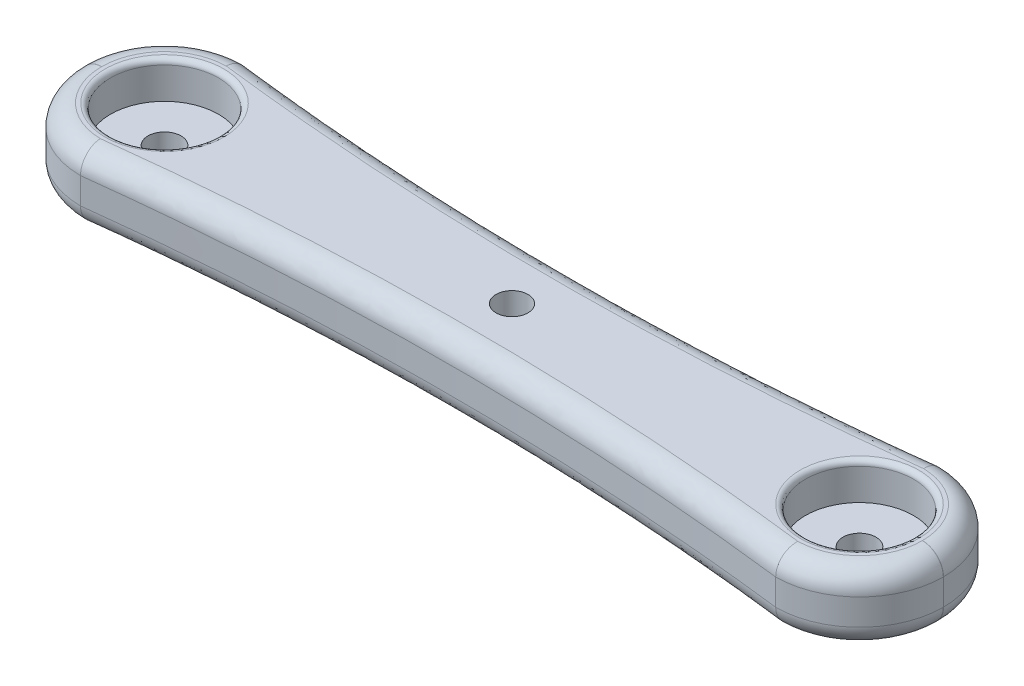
ISO-10303-21;
HEADER;
FILE_DESCRIPTION(('STEP AP214'),'2;1');
FILE_NAME('part.step','',(''),(''),'','','');
FILE_SCHEMA(('AUTOMOTIVE_DESIGN { 1 0 10303 214 1 1 1 1 }'));
ENDSEC;
DATA;
#1=APPLICATION_CONTEXT('core data for automotive mechanical design processes');
#2=APPLICATION_PROTOCOL_DEFINITION('international standard','automotive_design',2000,#1);
#3=PRODUCT_CONTEXT('',#1,'mechanical');
#4=PRODUCT('Part','Part','',(#3));
#5=PRODUCT_RELATED_PRODUCT_CATEGORY('part','',(#4));
#6=PRODUCT_DEFINITION_FORMATION('','',#4);
#7=PRODUCT_DEFINITION_CONTEXT('part definition',#1,'design');
#8=PRODUCT_DEFINITION('design','',#6,#7);
#9=PRODUCT_DEFINITION_SHAPE('','',#8);
#10=(LENGTH_UNIT() NAMED_UNIT(*) SI_UNIT(.MILLI.,.METRE.));
#11=(NAMED_UNIT(*) PLANE_ANGLE_UNIT() SI_UNIT($,.RADIAN.));
#12=(NAMED_UNIT(*) SI_UNIT($,.STERADIAN.) SOLID_ANGLE_UNIT());
#13=UNCERTAINTY_MEASURE_WITH_UNIT(LENGTH_MEASURE(1.E-05),#10,'distance_accuracy_value','');
#14=(GEOMETRIC_REPRESENTATION_CONTEXT(3) GLOBAL_UNCERTAINTY_ASSIGNED_CONTEXT((#13)) GLOBAL_UNIT_ASSIGNED_CONTEXT((#10,
#11,#12)) REPRESENTATION_CONTEXT('',''));
#15=CARTESIAN_POINT('',(0.,0.,0.));
#16=DIRECTION('',(0.,0.,1.));
#17=DIRECTION('',(1.,0.,0.));
#18=AXIS2_PLACEMENT_3D('',#15,#16,#17);
#19=CARTESIAN_POINT('',(-33.14,6.5,0.00999999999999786));
#20=DIRECTION('',(0.,-1.,0.));
#21=DIRECTION('',(0.,0.,-1.));
#22=AXIS2_PLACEMENT_3D('',#19,#20,#21);
#23=CYLINDRICAL_SURFACE('',#22,7.99);
#24=DIRECTION('',(0.,-1.,0.));
#25=VECTOR('',#24,1.);
#26=CARTESIAN_POINT('',(-41.13,6.5,0.00999999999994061));
#27=LINE('',#26,#25);
#28=CARTESIAN_POINT('',(-41.13,4.5,0.00999999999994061));
#29=VERTEX_POINT('',#28);
#30=CARTESIAN_POINT('',(-41.13,2.,0.00999999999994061));
#31=VERTEX_POINT('',#30);
#32=EDGE_CURVE('E448',#29,#31,#27,.T.);
#33=ORIENTED_EDGE('',*,*,#32,.T.);
#34=CARTESIAN_POINT('',(-33.14,2.,0.00999999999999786));
#35=DIRECTION('',(0.,1.,0.));
#36=DIRECTION('',(0.,0.,1.));
#37=AXIS2_PLACEMENT_3D('',#34,#35,#36);
#38=CIRCLE('',#37,7.99);
#39=CARTESIAN_POINT('',(-33.14,2.,8.));
#40=VERTEX_POINT('',#39);
#41=EDGE_CURVE('E340',#31,#40,#38,.T.);
#42=ORIENTED_EDGE('',*,*,#41,.T.);
#43=DIRECTION('',(0.,-1.,0.));
#44=VECTOR('',#43,1.);
#45=CARTESIAN_POINT('',(-33.14,6.5,8.));
#46=LINE('',#45,#44);
#47=CARTESIAN_POINT('',(-33.14,4.5,8.));
#48=VERTEX_POINT('',#47);
#49=EDGE_CURVE('E428',#48,#40,#46,.T.);
#50=ORIENTED_EDGE('',*,*,#49,.F.);
#51=CARTESIAN_POINT('',(-33.14,4.5,0.00999999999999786));
#52=DIRECTION('',(0.,1.,0.));
#53=DIRECTION('',(0.,0.,1.));
#54=AXIS2_PLACEMENT_3D('',#51,#52,#53);
#55=CIRCLE('',#54,7.99);
#56=EDGE_CURVE('E338',#48,#29,#55,.F.);
#57=ORIENTED_EDGE('',*,*,#56,.T.);
#58=EDGE_LOOP('',(#33,#42,#50,#57));
#59=FACE_BOUND('',#58,.T.);
#60=ADVANCED_FACE('F34',(#59),#23,.T.);
#61=CARTESIAN_POINT('',(-33.1399999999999,6.5,8.));
#62=CARTESIAN_POINT('',(0.,6.5,4.));
#63=CARTESIAN_POINT('',(33.14,6.5,8.));
#64=B_SPLINE_CURVE_WITH_KNOTS('',2,(#61,#62,#63),.UNSPECIFIED.,.F.,.F.,(3,3),(0.,1.),.UNSPECIFIED.);
#65=DIRECTION('',(0.,-1.,0.));
#66=VECTOR('',#65,1.);
#67=SURFACE_OF_LINEAR_EXTRUSION('',#64,#66);
#68=ORIENTED_EDGE('',*,*,#49,.T.);
#69=CARTESIAN_POINT('',(-50.2822222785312,0.,8.0545514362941));
#70=CARTESIAN_POINT('',(-50.042561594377,0.,10.0401402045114));
#71=CARTESIAN_POINT('',(-50.042561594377,2.,10.0401402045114));
#72=CARTESIAN_POINT('',(-44.6480350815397,0.,7.37450470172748));
#73=CARTESIAN_POINT('',(-44.4083743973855,0.,9.36009346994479));
#74=CARTESIAN_POINT('',(-44.4083743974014,2.,9.36009346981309));
#75=CARTESIAN_POINT('',(-39.0138478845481,0.,6.69445796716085));
#76=CARTESIAN_POINT('',(-38.774187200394,0.,8.68004673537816));
#77=CARTESIAN_POINT('',(-38.7741872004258,2.,8.68004673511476));
#78=CARTESIAN_POINT('',(-33.3796606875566,0.,6.01441123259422));
#79=CARTESIAN_POINT('',(-33.1400000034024,0.,8.00000000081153));
#80=CARTESIAN_POINT('',(-33.1400000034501,2.,8.00000000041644));
#81=CARTESIAN_POINT('',(-32.0264375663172,0.,5.8510782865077));
#82=CARTESIAN_POINT('',(-31.7963542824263,0.,7.83782303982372));
#83=CARTESIAN_POINT('',(-31.7963542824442,2.,7.83782303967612));
#84=CARTESIAN_POINT('',(-30.6720719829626,0.,5.69754009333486));
#85=CARTESIAN_POINT('',(-30.4515991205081,0.,7.68537449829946));
#86=CARTESIAN_POINT('',(-30.4515991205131,2.,7.68537449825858));
#87=CARTESIAN_POINT('',(-27.9610245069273,0.,5.41014770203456));
#88=CARTESIAN_POINT('',(-27.7598331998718,0.,7.40002612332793));
#89=CARTESIAN_POINT('',(-27.7598331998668,2.,7.40002612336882));
#90=CARTESIAN_POINT('',(-26.6043422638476,0.,5.27629680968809));
#91=CARTESIAN_POINT('',(-26.4128221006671,0.,7.26712957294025));
#92=CARTESIAN_POINT('',(-26.4128221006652,2.,7.26712957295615));
#93=CARTESIAN_POINT('',(-21.0508563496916,0.,4.76933438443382));
#94=CARTESIAN_POINT('',(-20.8990034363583,0.,6.76378810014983));
#95=CARTESIAN_POINT('',(-20.8990034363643,2.,6.76378810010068));
#96=CARTESIAN_POINT('',(-16.8459558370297,0.,4.48102694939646));
#97=CARTESIAN_POINT('',(-16.7243220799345,0.,6.4775559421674));
#98=CARTESIAN_POINT('',(-16.7243220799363,2.,6.47755594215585));
#99=CARTESIAN_POINT('',(-8.42731094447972,0.,4.09636051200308));
#100=CARTESIAN_POINT('',(-8.36636826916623,0.,6.09566257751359));
#101=CARTESIAN_POINT('',(-8.36636826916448,2.,6.09566257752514));
#102=CARTESIAN_POINT('',(-4.21356624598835,0.,4.00000854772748));
#103=CARTESIAN_POINT('',(-4.18309550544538,0.,6.00000835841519));
#104=CARTESIAN_POINT('',(-4.18309550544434,2.,6.00000835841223));
#105=CARTESIAN_POINT('',(2.80377024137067,0.,3.9999943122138));
#106=CARTESIAN_POINT('',(2.78349461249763,0.,5.99999443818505));
#107=CARTESIAN_POINT('',(2.78349461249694,2.,5.99999443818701));
#108=CARTESIAN_POINT('',(5.60746146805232,0.,4.04264728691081));
#109=CARTESIAN_POINT('',(5.56691071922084,0.,6.04233867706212));
#110=CARTESIAN_POINT('',(5.56691071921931,2.,6.04233867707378));
#111=CARTESIAN_POINT('',(11.212243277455,0.,4.21308196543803));
#112=CARTESIAN_POINT('',(11.1312168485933,0.,6.21154252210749));
#113=CARTESIAN_POINT('',(11.1312168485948,2.,6.21154252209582));
#114=CARTESIAN_POINT('',(14.0133339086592,0.,4.34086204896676));
#115=CARTESIAN_POINT('',(13.912106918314,0.,6.33840051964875));
#116=CARTESIAN_POINT('',(13.9121069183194,2.,6.33840051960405));
#117=CARTESIAN_POINT('',(19.5796885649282,0.,4.67924001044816));
#118=CARTESIAN_POINT('',(19.4384286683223,0.,6.67434479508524));
#119=CARTESIAN_POINT('',(19.4384286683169,2.,6.67434479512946));
#120=CARTESIAN_POINT('',(22.3450089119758,0.,4.88891530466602));
#121=CARTESIAN_POINT('',(22.1839150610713,0.,6.88251505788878));
#122=CARTESIAN_POINT('',(22.1839150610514,2.,6.88251505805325));
#123=CARTESIAN_POINT('',(27.8684122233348,0.,5.39031922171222));
#124=CARTESIAN_POINT('',(27.6678603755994,0.,7.38033747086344));
#125=CARTESIAN_POINT('',(27.6678603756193,2.,7.38033747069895));
#126=CARTESIAN_POINT('',(30.6264946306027,0.,5.68205398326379));
#127=CARTESIAN_POINT('',(30.4063187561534,0.,7.66999571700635));
#128=CARTESIAN_POINT('',(30.4063187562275,2.,7.66999571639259));
#129=CARTESIAN_POINT('',(33.3796606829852,0.,6.01441123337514));
#130=CARTESIAN_POINT('',(33.1399999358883,0.,7.99999999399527));
#131=CARTESIAN_POINT('',(33.1399999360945,2.,7.99999999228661));
#132=CARTESIAN_POINT('',(33.4404349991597,0.,6.02174669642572));
#133=CARTESIAN_POINT('',(33.2007742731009,0.,8.00733545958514));
#134=CARTESIAN_POINT('',(33.2007742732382,2.,8.00733545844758));
#135=CARTESIAN_POINT('',(33.5012093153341,0.,6.02908215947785));
#136=CARTESIAN_POINT('',(33.2615486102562,0.,8.01467092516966));
#137=CARTESIAN_POINT('',(33.2615486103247,2.,8.01467092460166));
#138=CARTESIAN_POINT('',(55.8162504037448,0.,8.72250875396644));
#139=CARTESIAN_POINT('',(55.5765973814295,0.,10.7080984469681));
#140=CARTESIAN_POINT('',(55.5765973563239,2.,10.7080986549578));
#141=CARTESIAN_POINT('',(78.0705171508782,0.,11.4086000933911));
#142=CARTESIAN_POINT('',(77.8308641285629,0.,13.3941897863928));
#143=CARTESIAN_POINT('',(77.8308641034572,2.,13.3941899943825));
#144=CARTESIAN_POINT('',(100.324783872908,0.,14.0946916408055));
#145=CARTESIAN_POINT('',(100.085123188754,0.,16.0802804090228));
#146=CARTESIAN_POINT('',(100.085123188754,2.,16.0802804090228));
#147=(BOUNDED_SURFACE() B_SPLINE_SURFACE(3,2,((#69,#70,#71),(#72,#73,#74),(#75,#76,#77),(#78,
#79,#80),(#81,#82,#83),(#84,#85,#86),(#87,#88,#89),(#90,#91,#92),(#93,#94,#95),(#96,#97,#98),
(#99,#100,#101),(#102,#103,#104),(#105,#106,#107),(#108,#109,#110),(#111,#112,#113),(#114,#115,
#116),(#117,#118,#119),(#120,#121,#122),(#123,#124,#125),(#126,#127,#128),(#129,#130,#131),
(#132,#133,#134),(#135,#136,#137),(#138,#139,#140),(#141,#142,#143),(#144,#145,#146)),
.UNSPECIFIED.,.F.,.F.,.F.) B_SPLINE_SURFACE_WITH_KNOTS((4,3,2,2,2,2,2,2,2,3,2,4),(3,3),(0.,
17.0252389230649,21.1142571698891,25.2039612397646,37.8435057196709,50.4835136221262,
58.8943646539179,67.3050555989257,75.6236094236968,83.9427857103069,84.1264319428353,
151.373790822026),(0.,1.),
.UNSPECIFIED.) GEOMETRIC_REPRESENTATION_ITEM() RATIONAL_B_SPLINE_SURFACE(((1.,0.707106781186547,
1.),(1.,0.707106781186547,1.),(1.,0.707106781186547,1.),(1.,0.707106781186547,1.),(1.,
0.707106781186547,1.),(1.,0.707106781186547,1.),(1.,0.707106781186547,1.),(1.,0.707106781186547,
1.),(1.,0.707106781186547,1.),(1.,0.707106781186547,1.),(1.,0.707106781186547,1.),(1.,
0.707106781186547,1.),(1.,0.707106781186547,1.),(1.,0.707106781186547,1.),(1.,0.707106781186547,
1.),(1.,0.707106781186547,1.),(1.,0.707106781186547,1.),(1.,0.707106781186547,1.),(1.,
0.707106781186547,1.),(1.,0.707106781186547,1.),(1.,0.707106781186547,1.),(1.,0.707106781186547,
1.),(1.,0.707106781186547,1.),(1.,0.707106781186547,1.),(1.,0.707106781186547,1.),(1.,
0.707106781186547,1.))) REPRESENTATION_ITEM('') SURFACE());
#148=CARTESIAN_POINT('',(-50.042561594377,2.,10.0401402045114));
#149=CARTESIAN_POINT('',(-44.4083743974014,2.,9.36009346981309));
#150=CARTESIAN_POINT('',(-38.7741872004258,2.,8.68004673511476));
#151=CARTESIAN_POINT('',(-33.1400000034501,2.,8.00000000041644));
#152=CARTESIAN_POINT('',(-31.7963542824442,2.,7.83782303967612));
#153=CARTESIAN_POINT('',(-30.4515991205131,2.,7.68537449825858));
#154=CARTESIAN_POINT('',(-27.7598331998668,2.,7.40002612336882));
#155=CARTESIAN_POINT('',(-26.4128221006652,2.,7.26712957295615));
#156=CARTESIAN_POINT('',(-20.8990034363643,2.,6.76378810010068));
#157=CARTESIAN_POINT('',(-16.7243220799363,2.,6.47755594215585));
#158=CARTESIAN_POINT('',(-8.36636826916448,2.,6.09566257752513));
#159=CARTESIAN_POINT('',(-4.18309550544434,2.,6.00000835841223));
#160=CARTESIAN_POINT('',(2.78349461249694,2.,5.99999443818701));
#161=CARTESIAN_POINT('',(5.56691071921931,2.,6.04233867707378));
#162=CARTESIAN_POINT('',(11.1312168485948,2.,6.21154252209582));
#163=CARTESIAN_POINT('',(13.9121069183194,2.,6.33840051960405));
#164=CARTESIAN_POINT('',(19.4384286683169,2.,6.67434479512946));
#165=CARTESIAN_POINT('',(22.1839150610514,2.,6.88251505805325));
#166=CARTESIAN_POINT('',(27.6678603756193,2.,7.38033747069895));
#167=CARTESIAN_POINT('',(30.4063187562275,2.,7.66999571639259));
#168=CARTESIAN_POINT('',(33.1399999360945,2.,7.99999999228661));
#169=CARTESIAN_POINT('',(33.2007742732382,2.,8.00733545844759));
#170=CARTESIAN_POINT('',(33.2615486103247,2.,8.01467092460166));
#171=CARTESIAN_POINT('',(55.5765973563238,2.,10.7080986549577));
#172=CARTESIAN_POINT('',(77.8308641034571,2.,13.3941899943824));
#173=CARTESIAN_POINT('',(100.085123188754,2.,16.0802804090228));
#174=B_SPLINE_CURVE_WITH_KNOTS('',3,(#148,#149,#150,#151,#152,#153,#154,#155,#156,#157,#158,
#159,#160,#161,#162,#163,#164,#165,#166,#167,#168,#169,#170,#171,#172,#173),.UNSPECIFIED.,.F.,
.F.,(4,3,2,2,2,2,2,2,2,3,2,4),(0.,17.0252389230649,21.1142571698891,25.2039612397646,
37.8435057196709,50.4835136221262,58.8943646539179,67.3050555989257,75.6236094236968,
83.9427857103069,84.1264319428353,151.373790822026),.UNSPECIFIED.);
#175=CARTESIAN_POINT('',(33.14,2.,8.));
#176=VERTEX_POINT('',#175);
#177=EDGE_CURVE('E49',#40,#176,#174,.T.);
#178=ORIENTED_EDGE('',*,*,#177,.T.);
#179=DIRECTION('',(0.,-1.,0.));
#180=VECTOR('',#179,1.);
#181=CARTESIAN_POINT('',(33.14,6.5,8.));
#182=LINE('',#181,#180);
#183=CARTESIAN_POINT('',(33.14,4.5,8.));
#184=VERTEX_POINT('',#183);
#185=EDGE_CURVE('E429',#184,#176,#182,.T.);
#186=ORIENTED_EDGE('',*,*,#185,.F.);
#187=CARTESIAN_POINT('',(50.2822222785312,6.5,8.0545514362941));
#188=CARTESIAN_POINT('',(50.0425615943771,6.5,10.0401402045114));
#189=CARTESIAN_POINT('',(50.0425615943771,4.5,10.0401402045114));
#190=CARTESIAN_POINT('',(44.6480350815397,6.5,7.37450470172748));
#191=CARTESIAN_POINT('',(44.4083743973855,6.5,9.36009346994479));
#192=CARTESIAN_POINT('',(44.4083743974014,4.5,9.36009346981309));
#193=CARTESIAN_POINT('',(39.0138478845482,6.5,6.69445796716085));
#194=CARTESIAN_POINT('',(38.774187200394,6.5,8.68004673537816));
#195=CARTESIAN_POINT('',(38.7741872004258,4.5,8.68004673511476));
#196=CARTESIAN_POINT('',(33.3796606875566,6.5,6.01441123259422));
#197=CARTESIAN_POINT('',(33.1400000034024,6.5,8.00000000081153));
#198=CARTESIAN_POINT('',(33.1400000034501,4.5,8.00000000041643));
#199=CARTESIAN_POINT('',(32.0264375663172,6.5,5.8510782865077));
#200=CARTESIAN_POINT('',(31.796354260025,6.5,7.83782303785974));
#201=CARTESIAN_POINT('',(31.7963542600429,4.5,7.83782303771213));
#202=CARTESIAN_POINT('',(30.6720719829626,6.5,5.69754009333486));
#203=CARTESIAN_POINT('',(30.4515991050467,6.5,7.6853744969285));
#204=CARTESIAN_POINT('',(30.4515991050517,4.5,7.68537449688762));
#205=CARTESIAN_POINT('',(27.9610245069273,6.5,5.41014770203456));
#206=CARTESIAN_POINT('',(27.7598332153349,6.5,7.40002612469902));
#207=CARTESIAN_POINT('',(27.7598332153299,4.5,7.40002612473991));
#208=CARTESIAN_POINT('',(26.6043422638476,6.5,5.27629680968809));
#209=CARTESIAN_POINT('',(26.4128221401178,6.5,7.26712957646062));
#210=CARTESIAN_POINT('',(26.4128221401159,4.5,7.26712957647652));
#211=CARTESIAN_POINT('',(21.0508563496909,6.5,4.76933438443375));
#212=CARTESIAN_POINT('',(20.8990035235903,6.5,6.7637881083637));
#213=CARTESIAN_POINT('',(20.8990035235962,4.5,6.76378810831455));
#214=CARTESIAN_POINT('',(16.8459558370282,6.5,4.48102694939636));
#215=CARTESIAN_POINT('',(16.7243220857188,6.5,6.47755594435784));
#216=CARTESIAN_POINT('',(16.7243220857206,4.5,6.47755594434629));
#217=CARTESIAN_POINT('',(8.42731094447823,6.5,4.09636051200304));
#218=CARTESIAN_POINT('',(8.36636826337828,6.5,6.0956625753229));
#219=CARTESIAN_POINT('',(8.36636826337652,4.5,6.09566257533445));
#220=CARTESIAN_POINT('',(4.21356624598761,6.5,4.00000854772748));
#221=CARTESIAN_POINT('',(4.18309556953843,6.5,6.000008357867));
#222=CARTESIAN_POINT('',(4.18309556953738,4.5,6.00000835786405));
#223=CARTESIAN_POINT('',(-2.80377024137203,6.5,3.9999943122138));
#224=CARTESIAN_POINT('',(-2.78349456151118,6.5,5.99999443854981));
#225=CARTESIAN_POINT('',(-2.78349456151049,4.5,5.99999443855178));
#226=CARTESIAN_POINT('',(-5.60746146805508,6.5,4.04264728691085));
#227=CARTESIAN_POINT('',(-5.56691070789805,6.5,6.04233867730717));
#228=CARTESIAN_POINT('',(-5.56691070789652,4.5,6.04233867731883));
#229=CARTESIAN_POINT('',(-11.2122432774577,6.5,4.21308196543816));
#230=CARTESIAN_POINT('',(-11.1312168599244,6.5,6.21154252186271));
#231=CARTESIAN_POINT('',(-11.1312168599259,4.5,6.21154252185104));
#232=CARTESIAN_POINT('',(-14.0133339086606,6.5,4.34086204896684));
#233=CARTESIAN_POINT('',(-13.9121069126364,6.49999999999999,6.33840051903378));
#234=CARTESIAN_POINT('',(-13.9121069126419,4.5,6.33840051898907));
#235=CARTESIAN_POINT('',(-19.5796885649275,6.5,4.67924001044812));
#236=CARTESIAN_POINT('',(-19.4384286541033,6.49999999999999,6.67434479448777));
#237=CARTESIAN_POINT('',(-19.438428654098,4.5,6.67434479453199));
#238=CARTESIAN_POINT('',(-22.3450089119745,6.5,4.88891530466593));
#239=CARTESIAN_POINT('',(-22.1839150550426,6.5,6.88251505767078));
#240=CARTESIAN_POINT('',(-22.1839150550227,4.5,6.88251505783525));
#241=CARTESIAN_POINT('',(-27.8684122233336,6.5,5.3903192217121));
#242=CARTESIAN_POINT('',(-27.6678603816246,6.5,7.38033747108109));
#243=CARTESIAN_POINT('',(-27.6678603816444,4.5,7.38033747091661));
#244=CARTESIAN_POINT('',(-30.6264946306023,6.5,5.68205398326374));
#245=CARTESIAN_POINT('',(-30.4063187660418,6.5,7.6699957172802));
#246=CARTESIAN_POINT('',(-30.4063187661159,4.5,7.66999571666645));
#247=CARTESIAN_POINT('',(-33.3796606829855,6.5,6.01441123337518));
#248=CARTESIAN_POINT('',(-33.1399999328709,6.5,7.99999999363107));
#249=CARTESIAN_POINT('',(-33.1399999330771,4.5,7.99999999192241));
#250=CARTESIAN_POINT('',(-33.4404349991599,6.5,6.02174669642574));
#251=CARTESIAN_POINT('',(-33.200774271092,6.5,8.00733545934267));
#252=CARTESIAN_POINT('',(-33.2007742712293,4.5,8.00733545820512));
#253=CARTESIAN_POINT('',(-33.5012093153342,6.5,6.02908215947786));
#254=CARTESIAN_POINT('',(-33.2615486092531,6.5,8.01467092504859));
#255=CARTESIAN_POINT('',(-33.2615486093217,4.5,8.01467092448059));
#256=CARTESIAN_POINT('',(-55.8162504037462,6.5,8.72250875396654));
#257=CARTESIAN_POINT('',(-55.5765977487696,6.49999999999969,10.7080984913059));
#258=CARTESIAN_POINT('',(-55.5765977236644,4.49999999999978,10.7080986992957));
#259=CARTESIAN_POINT('',(-78.0705171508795,6.5,11.4086000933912));
#260=CARTESIAN_POINT('',(-77.8308644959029,6.49999999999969,13.3941898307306));
#261=CARTESIAN_POINT('',(-77.8308644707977,4.49999999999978,13.3941900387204));
#262=CARTESIAN_POINT('',(-100.324783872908,6.5,14.0946916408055));
#263=CARTESIAN_POINT('',(-100.085123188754,6.5,16.0802804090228));
#264=CARTESIAN_POINT('',(-100.085123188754,4.5,16.0802804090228));
#265=(BOUNDED_SURFACE() B_SPLINE_SURFACE(3,2,((#187,#188,#189),(#190,#191,#192),(#193,#194,
#195),(#196,#197,#198),(#199,#200,#201),(#202,#203,#204),(#205,#206,#207),(#208,#209,#210),
(#211,#212,#213),(#214,#215,#216),(#217,#218,#219),(#220,#221,#222),(#223,#224,#225),(#226,#227,
#228),(#229,#230,#231),(#232,#233,#234),(#235,#236,#237),(#238,#239,#240),(#241,#242,#243),
(#244,#245,#246),(#247,#248,#249),(#250,#251,#252),(#253,#254,#255),(#256,#257,#258),(#259,#260,
#261),(#262,#263,#264)),.UNSPECIFIED.,.F.,.F.,.F.) B_SPLINE_SURFACE_WITH_KNOTS((4,3,2,2,2,2,2,2,
2,3,2,4),(3,3),(0.,17.0252389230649,21.1142571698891,25.2039612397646,37.8435057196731,
50.4835136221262,58.8943646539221,67.3050555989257,75.6236094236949,83.9427857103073,
84.1264319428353,151.373790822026),(0.,1.),
.UNSPECIFIED.) GEOMETRIC_REPRESENTATION_ITEM() RATIONAL_B_SPLINE_SURFACE(((1.,0.707106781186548,
1.),(1.,0.707106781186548,1.),(1.,0.707106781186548,1.),(1.,0.707106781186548,1.),(1.,
0.707106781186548,1.),(1.,0.707106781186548,1.),(1.,0.707106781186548,1.),(1.,0.707106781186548,
1.),(1.,0.707106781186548,1.),(1.,0.707106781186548,1.),(1.,0.707106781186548,1.),(1.,
0.707106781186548,1.),(1.,0.707106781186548,1.),(1.,0.707106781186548,1.),(1.,0.707106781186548,
1.),(1.,0.707106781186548,1.),(1.,0.707106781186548,1.),(1.,0.707106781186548,1.),(1.,
0.707106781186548,1.),(1.,0.707106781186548,1.),(1.,0.707106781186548,1.),(1.,0.707106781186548,
1.),(1.,0.707106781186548,1.),(1.,0.707106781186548,1.),(1.,0.707106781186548,1.),(1.,
0.707106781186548,1.))) REPRESENTATION_ITEM('') SURFACE());
#266=CARTESIAN_POINT('',(50.0425615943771,4.5,10.0401402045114));
#267=CARTESIAN_POINT('',(44.4083743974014,4.5,9.36009346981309));
#268=CARTESIAN_POINT('',(38.7741872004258,4.5,8.68004673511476));
#269=CARTESIAN_POINT('',(33.1400000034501,4.5,8.00000000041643));
#270=CARTESIAN_POINT('',(31.7963542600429,4.5,7.83782303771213));
#271=CARTESIAN_POINT('',(30.4515991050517,4.5,7.68537449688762));
#272=CARTESIAN_POINT('',(27.7598332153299,4.5,7.40002612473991));
#273=CARTESIAN_POINT('',(26.4128221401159,4.5,7.26712957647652));
#274=CARTESIAN_POINT('',(20.8990035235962,4.5,6.76378810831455));
#275=CARTESIAN_POINT('',(16.7243220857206,4.5,6.47755594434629));
#276=CARTESIAN_POINT('',(8.36636826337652,4.5,6.09566257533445));
#277=CARTESIAN_POINT('',(4.18309556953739,4.5,6.00000835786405));
#278=CARTESIAN_POINT('',(-2.78349456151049,4.5,5.99999443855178));
#279=CARTESIAN_POINT('',(-5.56691070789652,4.5,6.04233867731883));
#280=CARTESIAN_POINT('',(-11.1312168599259,4.5,6.21154252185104));
#281=CARTESIAN_POINT('',(-13.9121069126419,4.5,6.33840051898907));
#282=CARTESIAN_POINT('',(-19.438428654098,4.5,6.67434479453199));
#283=CARTESIAN_POINT('',(-22.1839150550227,4.5,6.88251505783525));
#284=CARTESIAN_POINT('',(-27.6678603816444,4.5,7.38033747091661));
#285=CARTESIAN_POINT('',(-30.4063187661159,4.5,7.66999571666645));
#286=CARTESIAN_POINT('',(-33.1399999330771,4.5,7.99999999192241));
#287=CARTESIAN_POINT('',(-33.2007742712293,4.5,8.00733545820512));
#288=CARTESIAN_POINT('',(-33.2615486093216,4.5,8.01467092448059));
#289=CARTESIAN_POINT('',(-55.5765977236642,4.49999999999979,10.7080986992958));
#290=CARTESIAN_POINT('',(-77.8308644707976,4.49999999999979,13.3941900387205));
#291=CARTESIAN_POINT('',(-100.085123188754,4.5,16.0802804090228));
#292=B_SPLINE_CURVE_WITH_KNOTS('',3,(#266,#267,#268,#269,#270,#271,#272,#273,#274,#275,#276,
#277,#278,#279,#280,#281,#282,#283,#284,#285,#286,#287,#288,#289,#290,#291),.UNSPECIFIED.,.F.,
.F.,(4,3,2,2,2,2,2,2,2,3,2,4),(0.,17.0252389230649,21.1142571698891,25.2039612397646,
37.8435057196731,50.4835136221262,58.8943646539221,67.3050555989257,75.6236094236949,
83.9427857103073,84.1264319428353,151.373790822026),.UNSPECIFIED.);
#293=EDGE_CURVE('E387',#184,#48,#292,.T.);
#294=ORIENTED_EDGE('',*,*,#293,.T.);
#295=EDGE_LOOP('',(#68,#178,#186,#294));
#296=FACE_BOUND('',#295,.T.);
#297=ADVANCED_FACE('F216',(#296),#67,.F.);
#298=CARTESIAN_POINT('',(33.14,6.5,0.00999999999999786));
#299=DIRECTION('',(0.,-1.,0.));
#300=DIRECTION('',(0.,0.,-1.));
#301=AXIS2_PLACEMENT_3D('',#298,#299,#300);
#302=CYLINDRICAL_SURFACE('',#301,7.99);
#303=ORIENTED_EDGE('',*,*,#185,.T.);
#304=CARTESIAN_POINT('',(33.14,2.,0.00999999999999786));
#305=DIRECTION('',(0.,1.,0.));
#306=DIRECTION('',(0.,0.,1.));
#307=AXIS2_PLACEMENT_3D('',#304,#305,#306);
#308=CIRCLE('',#307,7.99);
#309=CARTESIAN_POINT('',(41.13,2.,0.00999999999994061));
#310=VERTEX_POINT('',#309);
#311=EDGE_CURVE('E167',#176,#310,#308,.T.);
#312=ORIENTED_EDGE('',*,*,#311,.T.);
#313=DIRECTION('',(0.,-1.,0.));
#314=VECTOR('',#313,1.);
#315=CARTESIAN_POINT('',(41.13,6.5,0.00999999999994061));
#316=LINE('',#315,#314);
#317=CARTESIAN_POINT('',(41.13,4.5,0.00999999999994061));
#318=VERTEX_POINT('',#317);
#319=EDGE_CURVE('E433',#318,#310,#316,.T.);
#320=ORIENTED_EDGE('',*,*,#319,.F.);
#321=CARTESIAN_POINT('',(33.14,4.5,0.00999999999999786));
#322=DIRECTION('',(0.,1.,0.));
#323=DIRECTION('',(0.,0.,1.));
#324=AXIS2_PLACEMENT_3D('',#321,#322,#323);
#325=CIRCLE('',#324,7.99);
#326=EDGE_CURVE('E56',#318,#184,#325,.F.);
#327=ORIENTED_EDGE('',*,*,#326,.T.);
#328=EDGE_LOOP('',(#303,#312,#320,#327));
#329=FACE_BOUND('',#328,.T.);
#330=ADVANCED_FACE('F409',(#329),#302,.T.);
#331=CARTESIAN_POINT('',(41.13,6.5,0.));
#332=DIRECTION('',(-1.,0.,0.));
#333=DIRECTION('',(0.,0.,1.));
#334=AXIS2_PLACEMENT_3D('',#331,#332,#333);
#335=PLANE('',#334);
#336=ORIENTED_EDGE('',*,*,#319,.T.);
#337=DIRECTION('',(0.,0.,-1.));
#338=VECTOR('',#337,1.);
#339=CARTESIAN_POINT('',(41.13,2.,0.));
#340=LINE('',#339,#338);
#341=CARTESIAN_POINT('',(41.13,2.,-0.00999999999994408));
#342=VERTEX_POINT('',#341);
#343=EDGE_CURVE('E734',#310,#342,#340,.T.);
#344=ORIENTED_EDGE('',*,*,#343,.T.);
#345=DIRECTION('',(0.,-1.,0.));
#346=VECTOR('',#345,1.);
#347=CARTESIAN_POINT('',(41.13,6.5,-0.00999999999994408));
#348=LINE('',#347,#346);
#349=CARTESIAN_POINT('',(41.13,4.5,-0.00999999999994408));
#350=VERTEX_POINT('',#349);
#351=EDGE_CURVE('E436',#350,#342,#348,.T.);
#352=ORIENTED_EDGE('',*,*,#351,.F.);
#353=DIRECTION('',(0.,0.,-1.));
#354=VECTOR('',#353,1.);
#355=CARTESIAN_POINT('',(41.13,4.5,0.00999999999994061));
#356=LINE('',#355,#354);
#357=EDGE_CURVE('E718',#350,#318,#356,.F.);
#358=ORIENTED_EDGE('',*,*,#357,.T.);
#359=EDGE_LOOP('',(#336,#344,#352,#358));
#360=FACE_BOUND('',#359,.T.);
#361=ADVANCED_FACE('F557',(#360),#335,.F.);
#362=CARTESIAN_POINT('',(33.14,6.5,-0.0100000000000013));
#363=DIRECTION('',(0.,-1.,0.));
#364=DIRECTION('',(0.,0.,-1.));
#365=AXIS2_PLACEMENT_3D('',#362,#363,#364);
#366=CYLINDRICAL_SURFACE('',#365,7.99);
#367=DIRECTION('',(0.,-1.,0.));
#368=VECTOR('',#367,1.);
#369=CARTESIAN_POINT('',(33.14,6.5,-8.));
#370=LINE('',#369,#368);
#371=CARTESIAN_POINT('',(33.14,4.5,-8.));
#372=VERTEX_POINT('',#371);
#373=CARTESIAN_POINT('',(33.14,2.,-8.));
#374=VERTEX_POINT('',#373);
#375=EDGE_CURVE('E439',#372,#374,#370,.T.);
#376=ORIENTED_EDGE('',*,*,#375,.F.);
#377=CARTESIAN_POINT('',(33.14,4.5,-0.0100000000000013));
#378=DIRECTION('',(0.,1.,0.));
#379=DIRECTION('',(0.,0.,1.));
#380=AXIS2_PLACEMENT_3D('',#377,#378,#379);
#381=CIRCLE('',#380,7.99);
#382=EDGE_CURVE('E317',#372,#350,#381,.F.);
#383=ORIENTED_EDGE('',*,*,#382,.T.);
#384=ORIENTED_EDGE('',*,*,#351,.T.);
#385=CARTESIAN_POINT('',(33.14,2.,-0.0100000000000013));
#386=DIRECTION('',(0.,1.,0.));
#387=DIRECTION('',(0.,0.,1.));
#388=AXIS2_PLACEMENT_3D('',#385,#386,#387);
#389=CIRCLE('',#388,7.99);
#390=EDGE_CURVE('E740',#342,#374,#389,.T.);
#391=ORIENTED_EDGE('',*,*,#390,.T.);
#392=EDGE_LOOP('',(#376,#383,#384,#391));
#393=FACE_BOUND('',#392,.T.);
#394=ADVANCED_FACE('F565',(#393),#366,.T.);
#395=CARTESIAN_POINT('',(-33.1399999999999,6.5,-8.));
#396=CARTESIAN_POINT('',(0.,6.5,-4.));
#397=CARTESIAN_POINT('',(33.14,6.5,-8.));
#398=B_SPLINE_CURVE_WITH_KNOTS('',2,(#395,#396,#397),.UNSPECIFIED.,.F.,.F.,(3,3),(0.,1.),.UNSPECIFIED.);
#399=DIRECTION('',(0.,-1.,0.));
#400=VECTOR('',#399,1.);
#401=SURFACE_OF_LINEAR_EXTRUSION('',#398,#400);
#402=ORIENTED_EDGE('',*,*,#375,.T.);
#403=CARTESIAN_POINT('',(50.2822222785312,0.,-8.05455143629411));
#404=CARTESIAN_POINT('',(50.0425615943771,0.,-10.0401402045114));
#405=CARTESIAN_POINT('',(50.0425615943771,2.,-10.0401402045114));
#406=CARTESIAN_POINT('',(44.6480350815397,0.,-7.37450470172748));
#407=CARTESIAN_POINT('',(44.4083743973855,0.,-9.3600934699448));
#408=CARTESIAN_POINT('',(44.4083743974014,2.,-9.3600934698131));
#409=CARTESIAN_POINT('',(39.0138478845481,0.,-6.69445796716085));
#410=CARTESIAN_POINT('',(38.774187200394,0.,-8.68004673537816));
#411=CARTESIAN_POINT('',(38.7741872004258,2.,-8.68004673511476));
#412=CARTESIAN_POINT('',(33.3796606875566,0.,-6.01441123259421));
#413=CARTESIAN_POINT('',(33.1400000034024,0.,-8.00000000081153));
#414=CARTESIAN_POINT('',(33.1400000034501,2.,-8.00000000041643));
#415=CARTESIAN_POINT('',(32.0264375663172,0.,-5.8510782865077));
#416=CARTESIAN_POINT('',(31.7963542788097,0.,-7.83782303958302));
#417=CARTESIAN_POINT('',(31.7963542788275,2.,-7.83782303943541));
#418=CARTESIAN_POINT('',(30.6720719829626,0.,-5.69754009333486));
#419=CARTESIAN_POINT('',(30.451599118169,0.,-7.68537449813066));
#420=CARTESIAN_POINT('',(30.451599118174,2.,-7.68537449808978));
#421=CARTESIAN_POINT('',(27.9610245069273,0.,-5.41014770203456));
#422=CARTESIAN_POINT('',(27.7598332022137,0.,-7.40002612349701));
#423=CARTESIAN_POINT('',(27.7598332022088,2.,-7.4000261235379));
#424=CARTESIAN_POINT('',(26.6043422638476,0.,-5.27629680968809));
#425=CARTESIAN_POINT('',(26.412822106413,0.,-7.26712957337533));
#426=CARTESIAN_POINT('',(26.4128221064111,2.,-7.26712957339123));
#427=CARTESIAN_POINT('',(21.0508563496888,0.,-4.76933438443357));
#428=CARTESIAN_POINT('',(20.8990034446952,0.,-6.76378810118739));
#429=CARTESIAN_POINT('',(20.8990034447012,2.,-6.76378810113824));
#430=CARTESIAN_POINT('',(16.8459558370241,0.,-4.48102694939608));
#431=CARTESIAN_POINT('',(16.7243220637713,0.,-6.47755594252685));
#432=CARTESIAN_POINT('',(16.7243220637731,2.,-6.47755594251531));
#433=CARTESIAN_POINT('',(8.4273109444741,0.,-4.09636051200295));
#434=CARTESIAN_POINT('',(8.36636828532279,0.,-6.09566257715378));
#435=CARTESIAN_POINT('',(8.36636828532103,2.,-6.09566257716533));
#436=CARTESIAN_POINT('',(4.21356624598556,0.,-4.00000854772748));
#437=CARTESIAN_POINT('',(4.1830955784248,0.,-6.00000835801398));
#438=CARTESIAN_POINT('',(4.18309557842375,2.,-6.00000835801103));
#439=CARTESIAN_POINT('',(-2.8037702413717,0.,-3.9999943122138));
#440=CARTESIAN_POINT('',(-2.78349456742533,0.,-5.99999443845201));
#441=CARTESIAN_POINT('',(-2.78349456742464,2.,-5.99999443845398));
#442=CARTESIAN_POINT('',(-5.60746146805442,0.,-4.04264728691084));
#443=CARTESIAN_POINT('',(-5.56691071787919,0.,-6.04233867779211));
#444=CARTESIAN_POINT('',(-5.56691071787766,2.,-6.04233867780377));
#445=CARTESIAN_POINT('',(-11.212243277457,0.,-4.21308196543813));
#446=CARTESIAN_POINT('',(-11.1312168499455,0.,-6.21154252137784));
#447=CARTESIAN_POINT('',(-11.131216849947,2.,-6.21154252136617));
#448=CARTESIAN_POINT('',(-14.0133339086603,0.,-4.34086204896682));
#449=CARTESIAN_POINT('',(-13.9121068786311,0.,-6.33840051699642));
#450=CARTESIAN_POINT('',(-13.9121068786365,2.,-6.33840051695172));
#451=CARTESIAN_POINT('',(-19.5796885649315,0.,-4.67924001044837));
#452=CARTESIAN_POINT('',(-19.4384286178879,0.,-6.67434479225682));
#453=CARTESIAN_POINT('',(-19.4384286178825,2.,-6.67434479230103));
#454=CARTESIAN_POINT('',(-22.3450089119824,0.,-4.88891530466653));
#455=CARTESIAN_POINT('',(-22.1839150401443,0.,-6.88251505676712));
#456=CARTESIAN_POINT('',(-22.1839150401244,2.,-6.88251505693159));
#457=CARTESIAN_POINT('',(-27.8684122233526,0.,-5.39031922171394));
#458=CARTESIAN_POINT('',(-27.6678603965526,0.,-7.38033747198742));
#459=CARTESIAN_POINT('',(-27.6678603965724,2.,-7.38033747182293));
#460=CARTESIAN_POINT('',(-30.6264946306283,0.,-5.68205398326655));
#461=CARTESIAN_POINT('',(-30.406318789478,0.,-7.66999571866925));
#462=CARTESIAN_POINT('',(-30.4063187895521,2.00000000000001,-7.6699957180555));
#463=CARTESIAN_POINT('',(-33.3796606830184,0.,-6.01441123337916));
#464=CARTESIAN_POINT('',(-33.1399999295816,0.,-7.99999999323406));
#465=CARTESIAN_POINT('',(-33.1399999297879,2.,-7.9999999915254));
#466=CARTESIAN_POINT('',(-33.4404349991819,0.,-6.0217466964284));
#467=CARTESIAN_POINT('',(-33.2007742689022,0.,-8.00733545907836));
#468=CARTESIAN_POINT('',(-33.2007742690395,2.,-8.00733545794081));
#469=CARTESIAN_POINT('',(-33.5012093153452,0.,-6.02908215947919));
#470=CARTESIAN_POINT('',(-33.2615486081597,0.,-8.01467092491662));
#471=CARTESIAN_POINT('',(-33.2615486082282,2.,-8.01467092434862));
#472=CARTESIAN_POINT('',(-55.8162504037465,0.,-8.72250875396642));
#473=CARTESIAN_POINT('',(-55.5765981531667,0.,-10.7080985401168));
#474=CARTESIAN_POINT('',(-55.5765981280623,2.,-10.7080987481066));
#475=CARTESIAN_POINT('',(-78.0705171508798,0.,-11.4086000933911));
#476=CARTESIAN_POINT('',(-77.8308649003,0.,-13.3941898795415));
#477=CARTESIAN_POINT('',(-77.8308648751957,2.,-13.3941900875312));
#478=CARTESIAN_POINT('',(-100.324783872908,0.,-14.0946916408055));
#479=CARTESIAN_POINT('',(-100.085123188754,0.,-16.0802804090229));
#480=CARTESIAN_POINT('',(-100.085123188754,2.,-16.0802804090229));
#481=(BOUNDED_SURFACE() B_SPLINE_SURFACE(3,2,((#403,#404,#405),(#406,#407,#408),(#409,#410,
#411),(#412,#413,#414),(#415,#416,#417),(#418,#419,#420),(#421,#422,#423),(#424,#425,#426),
(#427,#428,#429),(#430,#431,#432),(#433,#434,#435),(#436,#437,#438),(#439,#440,#441),(#442,#443,
#444),(#445,#446,#447),(#448,#449,#450),(#451,#452,#453),(#454,#455,#456),(#457,#458,#459),
(#460,#461,#462),(#463,#464,#465),(#466,#467,#468),(#469,#470,#471),(#472,#473,#474),(#475,#476,
#477),(#478,#479,#480)),.UNSPECIFIED.,.F.,.F.,.F.) B_SPLINE_SURFACE_WITH_KNOTS((4,3,2,2,2,2,2,2,
2,3,2,4),(3,3),(0.,17.0252389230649,21.1142571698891,25.2039612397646,37.8435057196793,
50.4835136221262,58.8943646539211,67.3050555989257,75.6236094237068,83.9427857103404,
84.1264319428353,151.373790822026),(0.,1.),
.UNSPECIFIED.) GEOMETRIC_REPRESENTATION_ITEM() RATIONAL_B_SPLINE_SURFACE(((1.,0.707106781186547,
1.),(1.,0.707106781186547,1.),(1.,0.707106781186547,1.),(1.,0.707106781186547,1.),(1.,
0.707106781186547,1.),(1.,0.707106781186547,1.),(1.,0.707106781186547,1.),(1.,0.707106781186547,
1.),(1.,0.707106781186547,1.),(1.,0.707106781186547,1.),(1.,0.707106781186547,1.),(1.,
0.707106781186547,1.),(1.,0.707106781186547,1.),(1.,0.707106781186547,1.),(1.,0.707106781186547,
1.),(1.,0.707106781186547,1.),(1.,0.707106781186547,1.),(1.,0.707106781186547,1.),(1.,
0.707106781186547,1.),(1.,0.707106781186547,1.),(1.,0.707106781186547,1.),(1.,0.707106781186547,
1.),(1.,0.707106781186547,1.),(1.,0.707106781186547,1.),(1.,0.707106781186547,1.),(1.,
0.707106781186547,1.))) REPRESENTATION_ITEM('') SURFACE());
#482=CARTESIAN_POINT('',(50.0425615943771,2.,-10.0401402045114));
#483=CARTESIAN_POINT('',(44.4083743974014,2.,-9.3600934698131));
#484=CARTESIAN_POINT('',(38.7741872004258,2.,-8.68004673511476));
#485=CARTESIAN_POINT('',(33.1400000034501,2.,-8.00000000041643));
#486=CARTESIAN_POINT('',(31.7963542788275,2.,-7.83782303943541));
#487=CARTESIAN_POINT('',(30.4515991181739,2.,-7.68537449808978));
#488=CARTESIAN_POINT('',(27.7598332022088,2.,-7.4000261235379));
#489=CARTESIAN_POINT('',(26.4128221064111,2.,-7.26712957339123));
#490=CARTESIAN_POINT('',(20.8990034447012,2.,-6.76378810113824));
#491=CARTESIAN_POINT('',(16.7243220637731,2.,-6.4775559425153));
#492=CARTESIAN_POINT('',(8.36636828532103,2.,-6.09566257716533));
#493=CARTESIAN_POINT('',(4.18309557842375,2.,-6.00000835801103));
#494=CARTESIAN_POINT('',(-2.78349456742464,2.,-5.99999443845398));
#495=CARTESIAN_POINT('',(-5.56691071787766,2.,-6.04233867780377));
#496=CARTESIAN_POINT('',(-11.131216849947,2.,-6.21154252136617));
#497=CARTESIAN_POINT('',(-13.9121068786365,2.,-6.33840051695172));
#498=CARTESIAN_POINT('',(-19.4384286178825,2.,-6.67434479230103));
#499=CARTESIAN_POINT('',(-22.1839150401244,2.,-6.88251505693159));
#500=CARTESIAN_POINT('',(-27.6678603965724,2.,-7.38033747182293));
#501=CARTESIAN_POINT('',(-30.4063187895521,2.00000000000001,-7.6699957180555));
#502=CARTESIAN_POINT('',(-33.1399999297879,2.,-7.9999999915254));
#503=CARTESIAN_POINT('',(-33.2007742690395,2.,-8.00733545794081));
#504=CARTESIAN_POINT('',(-33.2615486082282,2.,-8.01467092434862));
#505=CARTESIAN_POINT('',(-55.5765981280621,2.,-10.7080987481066));
#506=CARTESIAN_POINT('',(-77.8308648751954,2.,-13.3941900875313));
#507=CARTESIAN_POINT('',(-100.085123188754,2.,-16.0802804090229));
#508=B_SPLINE_CURVE_WITH_KNOTS('',3,(#482,#483,#484,#485,#486,#487,#488,#489,#490,#491,#492,
#493,#494,#495,#496,#497,#498,#499,#500,#501,#502,#503,#504,#505,#506,#507),.UNSPECIFIED.,.F.,
.F.,(4,3,2,2,2,2,2,2,2,3,2,4),(0.,17.0252389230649,21.1142571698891,25.2039612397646,
37.8435057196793,50.4835136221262,58.8943646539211,67.3050555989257,75.6236094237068,
83.9427857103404,84.1264319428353,151.373790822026),.UNSPECIFIED.);
#509=CARTESIAN_POINT('',(-33.1399999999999,2.,-8.));
#510=VERTEX_POINT('',#509);
#511=EDGE_CURVE('E347',#374,#510,#508,.T.);
#512=ORIENTED_EDGE('',*,*,#511,.T.);
#513=DIRECTION('',(0.,-1.,0.));
#514=VECTOR('',#513,1.);
#515=CARTESIAN_POINT('',(-33.1399999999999,6.5,-8.));
#516=LINE('',#515,#514);
#517=CARTESIAN_POINT('',(-33.1399999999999,4.5,-8.));
#518=VERTEX_POINT('',#517);
#519=EDGE_CURVE('E442',#518,#510,#516,.T.);
#520=ORIENTED_EDGE('',*,*,#519,.F.);
#521=CARTESIAN_POINT('',(-50.2822222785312,6.5,-8.05455143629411));
#522=CARTESIAN_POINT('',(-50.042561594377,6.5,-10.0401402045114));
#523=CARTESIAN_POINT('',(-50.042561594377,4.5,-10.0401402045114));
#524=CARTESIAN_POINT('',(-44.6480350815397,6.5,-7.37450470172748));
#525=CARTESIAN_POINT('',(-44.4083743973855,6.5,-9.3600934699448));
#526=CARTESIAN_POINT('',(-44.4083743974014,4.5,-9.3600934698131));
#527=CARTESIAN_POINT('',(-39.0138478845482,6.5,-6.69445796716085));
#528=CARTESIAN_POINT('',(-38.774187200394,6.5,-8.68004673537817));
#529=CARTESIAN_POINT('',(-38.7741872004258,4.5,-8.68004673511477));
#530=CARTESIAN_POINT('',(-33.3796606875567,6.5,-6.01441123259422));
#531=CARTESIAN_POINT('',(-33.1400000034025,6.5,-8.00000000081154));
#532=CARTESIAN_POINT('',(-33.1400000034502,4.5,-8.00000000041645));
#533=CARTESIAN_POINT('',(-32.0264375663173,6.5,-5.8510782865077));
#534=CARTESIAN_POINT('',(-31.7963542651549,6.5,-7.83782303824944));
#535=CARTESIAN_POINT('',(-31.7963542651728,4.5,-7.83782303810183));
#536=CARTESIAN_POINT('',(-30.6720719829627,6.5,-5.69754009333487));
#537=CARTESIAN_POINT('',(-30.4515991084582,6.5,-7.68537449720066));
#538=CARTESIAN_POINT('',(-30.4515991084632,4.5,-7.68537449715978));
#539=CARTESIAN_POINT('',(-27.9610245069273,6.5,-5.41014770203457));
#540=CARTESIAN_POINT('',(-27.7598332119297,6.5,-7.40002612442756));
#541=CARTESIAN_POINT('',(-27.7598332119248,4.5,-7.40002612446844));
#542=CARTESIAN_POINT('',(-26.6043422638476,6.5,-5.27629680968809));
#543=CARTESIAN_POINT('',(-26.4128221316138,6.5,-7.26712957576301));
#544=CARTESIAN_POINT('',(-26.4128221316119,4.5,-7.26712957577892));
#545=CARTESIAN_POINT('',(-21.0508563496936,6.5,-4.769334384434));
#546=CARTESIAN_POINT('',(-20.8990035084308,6.5,-6.76378810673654));
#547=CARTESIAN_POINT('',(-20.8990035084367,4.5,-6.7637881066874));
#548=CARTESIAN_POINT('',(-16.8459558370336,6.5,-4.48102694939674));
#549=CARTESIAN_POINT('',(-16.7243220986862,6.5,-6.47755594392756));
#550=CARTESIAN_POINT('',(-16.7243220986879,4.5,-6.47755594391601));
#551=CARTESIAN_POINT('',(-8.42731094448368,6.5,-4.09636051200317));
#552=CARTESIAN_POINT('',(-8.36636825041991,6.5,-6.09566257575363));
#553=CARTESIAN_POINT('',(-8.36636825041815,4.5,-6.09566257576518));
#554=CARTESIAN_POINT('',(-4.21356624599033,6.5,-4.00000854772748));
#555=CARTESIAN_POINT('',(-4.18309550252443,6.5,-6.00000835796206));
#556=CARTESIAN_POINT('',(-4.18309550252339,4.5,-6.0000083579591));
#557=CARTESIAN_POINT('',(2.80377024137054,6.5,-3.9999943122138));
#558=CARTESIAN_POINT('',(2.78349461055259,6.5,-5.99999443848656));
#559=CARTESIAN_POINT('',(2.78349461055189,4.5,-5.99999443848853));
#560=CARTESIAN_POINT('',(5.60746146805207,6.5,-4.0426472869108));
#561=CARTESIAN_POINT('',(5.56691072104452,6.5,-6.0423386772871));
#562=CARTESIAN_POINT('',(5.56691072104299,4.5,-6.04233867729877));
#563=CARTESIAN_POINT('',(11.2122432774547,6.5,-4.21308196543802));
#564=CARTESIAN_POINT('',(11.1312168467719,6.5,-6.21154252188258));
#565=CARTESIAN_POINT('',(11.1312168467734,4.5,-6.21154252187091));
#566=CARTESIAN_POINT('',(14.0133339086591,6.5,-4.34086204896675));
#567=CARTESIAN_POINT('',(13.9121069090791,6.5,-6.33840051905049));
#568=CARTESIAN_POINT('',(13.9121069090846,4.5,-6.33840051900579));
#569=CARTESIAN_POINT('',(19.5796885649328,6.5,-4.67924001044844));
#570=CARTESIAN_POINT('',(19.4384286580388,6.5,-6.6743447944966));
#571=CARTESIAN_POINT('',(19.4384286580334,4.5,-6.67434479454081));
#572=CARTESIAN_POINT('',(22.3450089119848,6.5,-4.88891530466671));
#573=CARTESIAN_POINT('',(22.1839150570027,6.5,-6.882515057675));
#574=CARTESIAN_POINT('',(22.1839150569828,4.5,-6.88251505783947));
#575=CARTESIAN_POINT('',(27.868412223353,6.5,-5.39031922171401));
#576=CARTESIAN_POINT('',(27.6678603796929,6.5,-7.38033747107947));
#577=CARTESIAN_POINT('',(27.6678603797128,4.5,-7.38033747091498));
#578=CARTESIAN_POINT('',(30.6264946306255,6.5,-5.68205398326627));
#579=CARTESIAN_POINT('',(30.4063187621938,6.5,-7.6699957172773));
#580=CARTESIAN_POINT('',(30.4063187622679,4.5,-7.66999571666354));
#581=CARTESIAN_POINT('',(33.3796606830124,6.5,-6.01441123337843));
#582=CARTESIAN_POINT('',(33.1399999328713,6.5,-7.99999999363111));
#583=CARTESIAN_POINT('',(33.1399999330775,4.5,-7.99999999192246));
#584=CARTESIAN_POINT('',(33.4404349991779,6.5,-6.02174669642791));
#585=CARTESIAN_POINT('',(33.2007742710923,6.5,-8.0073354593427));
#586=CARTESIAN_POINT('',(33.2007742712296,4.5,-8.00733545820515));
#587=CARTESIAN_POINT('',(33.5012093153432,6.5,-6.02908215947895));
#588=CARTESIAN_POINT('',(33.2615486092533,6.5,-8.01467092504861));
#589=CARTESIAN_POINT('',(33.2615486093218,4.5,-8.01467092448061));
#590=CARTESIAN_POINT('',(55.816250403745,6.5,-8.72250875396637));
#591=CARTESIAN_POINT('',(55.5765977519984,6.5,-10.7080984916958));
#592=CARTESIAN_POINT('',(55.5765977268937,4.50000000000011,-10.7080986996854));
#593=CARTESIAN_POINT('',(78.0705171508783,6.5,-11.408600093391));
#594=CARTESIAN_POINT('',(77.8308644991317,6.5,-13.3941898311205));
#595=CARTESIAN_POINT('',(77.830864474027,4.50000000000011,-13.3941900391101));
#596=CARTESIAN_POINT('',(100.324783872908,6.5,-14.0946916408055));
#597=CARTESIAN_POINT('',(100.085123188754,6.5,-16.0802804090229));
#598=CARTESIAN_POINT('',(100.085123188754,4.5,-16.0802804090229));
#599=(BOUNDED_SURFACE() B_SPLINE_SURFACE(3,2,((#521,#522,#523),(#524,#525,#526),(#527,#528,
#529),(#530,#531,#532),(#533,#534,#535),(#536,#537,#538),(#539,#540,#541),(#542,#543,#544),
(#545,#546,#547),(#548,#549,#550),(#551,#552,#553),(#554,#555,#556),(#557,#558,#559),(#560,#561,
#562),(#563,#564,#565),(#566,#567,#568),(#569,#570,#571),(#572,#573,#574),(#575,#576,#577),
(#578,#579,#580),(#581,#582,#583),(#584,#585,#586),(#587,#588,#589),(#590,#591,#592),(#593,#594,
#595),(#596,#597,#598)),.UNSPECIFIED.,.F.,.F.,.F.) B_SPLINE_SURFACE_WITH_KNOTS((4,3,2,2,2,2,2,2,
2,3,2,4),(3,3),(0.,17.0252389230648,21.1142571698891,25.2039612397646,37.8435057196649,
50.4835136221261,58.8943646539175,67.3050555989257,75.6236094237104,83.9427857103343,
84.1264319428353,151.373790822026),(0.,1.),
.UNSPECIFIED.) GEOMETRIC_REPRESENTATION_ITEM() RATIONAL_B_SPLINE_SURFACE(((1.,0.707106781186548,
1.),(1.,0.707106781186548,1.),(1.,0.707106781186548,1.),(1.,0.707106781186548,1.),(1.,
0.707106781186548,1.),(1.,0.707106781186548,1.),(1.,0.707106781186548,1.),(1.,0.707106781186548,
1.),(1.,0.707106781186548,1.),(1.,0.707106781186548,1.),(1.,0.707106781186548,1.),(1.,
0.707106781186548,1.),(1.,0.707106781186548,1.),(1.,0.707106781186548,1.),(1.,0.707106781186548,
1.),(1.,0.707106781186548,1.),(1.,0.707106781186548,1.),(1.,0.707106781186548,1.),(1.,
0.707106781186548,1.),(1.,0.707106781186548,1.),(1.,0.707106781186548,1.),(1.,0.707106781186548,
1.),(1.,0.707106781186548,1.),(1.,0.707106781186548,1.),(1.,0.707106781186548,1.),(1.,
0.707106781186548,1.))) REPRESENTATION_ITEM('') SURFACE());
#600=CARTESIAN_POINT('',(-50.042561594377,4.5,-10.0401402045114));
#601=CARTESIAN_POINT('',(-44.4083743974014,4.5,-9.3600934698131));
#602=CARTESIAN_POINT('',(-38.7741872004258,4.5,-8.68004673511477));
#603=CARTESIAN_POINT('',(-33.1400000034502,4.5,-8.00000000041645));
#604=CARTESIAN_POINT('',(-31.7963542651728,4.5,-7.83782303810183));
#605=CARTESIAN_POINT('',(-30.4515991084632,4.5,-7.68537449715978));
#606=CARTESIAN_POINT('',(-27.7598332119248,4.5,-7.40002612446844));
#607=CARTESIAN_POINT('',(-26.4128221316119,4.5,-7.26712957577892));
#608=CARTESIAN_POINT('',(-20.8990035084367,4.5,-6.7637881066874));
#609=CARTESIAN_POINT('',(-16.7243220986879,4.5,-6.47755594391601));
#610=CARTESIAN_POINT('',(-8.36636825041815,4.5,-6.09566257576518));
#611=CARTESIAN_POINT('',(-4.18309550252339,4.5,-6.0000083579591));
#612=CARTESIAN_POINT('',(2.78349461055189,4.5,-5.99999443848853));
#613=CARTESIAN_POINT('',(5.56691072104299,4.5,-6.04233867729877));
#614=CARTESIAN_POINT('',(11.1312168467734,4.5,-6.21154252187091));
#615=CARTESIAN_POINT('',(13.9121069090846,4.5,-6.33840051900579));
#616=CARTESIAN_POINT('',(19.4384286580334,4.5,-6.67434479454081));
#617=CARTESIAN_POINT('',(22.1839150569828,4.5,-6.88251505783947));
#618=CARTESIAN_POINT('',(27.6678603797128,4.5,-7.38033747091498));
#619=CARTESIAN_POINT('',(30.4063187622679,4.5,-7.66999571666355));
#620=CARTESIAN_POINT('',(33.1399999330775,4.5,-7.99999999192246));
#621=CARTESIAN_POINT('',(33.2007742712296,4.5,-8.00733545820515));
#622=CARTESIAN_POINT('',(33.2615486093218,4.5,-8.01467092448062));
#623=CARTESIAN_POINT('',(55.5765977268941,4.50000000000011,-10.7080986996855));
#624=CARTESIAN_POINT('',(77.8308644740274,4.50000000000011,-13.3941900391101));
#625=CARTESIAN_POINT('',(100.085123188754,4.5,-16.0802804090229));
#626=B_SPLINE_CURVE_WITH_KNOTS('',3,(#600,#601,#602,#603,#604,#605,#606,#607,#608,#609,#610,
#611,#612,#613,#614,#615,#616,#617,#618,#619,#620,#621,#622,#623,#624,#625),.UNSPECIFIED.,.F.,
.F.,(4,3,2,2,2,2,2,2,2,3,2,4),(0.,17.0252389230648,21.1142571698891,25.2039612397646,
37.8435057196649,50.4835136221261,58.8943646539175,67.3050555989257,75.6236094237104,
83.9427857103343,84.1264319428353,151.373790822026),.UNSPECIFIED.);
#627=EDGE_CURVE('E342',#518,#372,#626,.T.);
#628=ORIENTED_EDGE('',*,*,#627,.T.);
#629=EDGE_LOOP('',(#402,#512,#520,#628));
#630=FACE_BOUND('',#629,.T.);
#631=ADVANCED_FACE('F286',(#630),#401,.T.);
#632=CARTESIAN_POINT('',(-33.14,6.5,-0.0100000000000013));
#633=DIRECTION('',(0.,-1.,0.));
#634=DIRECTION('',(0.,0.,-1.));
#635=AXIS2_PLACEMENT_3D('',#632,#633,#634);
#636=CYLINDRICAL_SURFACE('',#635,7.99);
#637=ORIENTED_EDGE('',*,*,#519,.T.);
#638=CARTESIAN_POINT('',(-33.14,2.,-0.0100000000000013));
#639=DIRECTION('',(0.,1.,0.));
#640=DIRECTION('',(0.,0.,1.));
#641=AXIS2_PLACEMENT_3D('',#638,#639,#640);
#642=CIRCLE('',#641,7.99);
#643=CARTESIAN_POINT('',(-41.13,2.,-0.00999999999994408));
#644=VERTEX_POINT('',#643);
#645=EDGE_CURVE('E336',#510,#644,#642,.T.);
#646=ORIENTED_EDGE('',*,*,#645,.T.);
#647=DIRECTION('',(0.,-1.,0.));
#648=VECTOR('',#647,1.);
#649=CARTESIAN_POINT('',(-41.13,6.5,-0.00999999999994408));
#650=LINE('',#649,#648);
#651=CARTESIAN_POINT('',(-41.13,4.5,-0.00999999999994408));
#652=VERTEX_POINT('',#651);
#653=EDGE_CURVE('E445',#652,#644,#650,.T.);
#654=ORIENTED_EDGE('',*,*,#653,.F.);
#655=CARTESIAN_POINT('',(-33.14,4.5,-0.0100000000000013));
#656=DIRECTION('',(0.,1.,0.));
#657=DIRECTION('',(0.,0.,1.));
#658=AXIS2_PLACEMENT_3D('',#655,#656,#657);
#659=CIRCLE('',#658,7.99);
#660=EDGE_CURVE('E332',#652,#518,#659,.F.);
#661=ORIENTED_EDGE('',*,*,#660,.T.);
#662=EDGE_LOOP('',(#637,#646,#654,#661));
#663=FACE_BOUND('',#662,.T.);
#664=ADVANCED_FACE('F415',(#663),#636,.T.);
#665=CARTESIAN_POINT('',(0.,6.5,0.));
#666=DIRECTION('',(0.,-1.,0.));
#667=DIRECTION('',(0.,0.,-1.));
#668=AXIS2_PLACEMENT_3D('',#665,#666,#667);
#669=CYLINDRICAL_SURFACE('',#668,1.525);
#670=CARTESIAN_POINT('',(0.,6.5,0.));
#671=DIRECTION('',(0.,1.,0.));
#672=DIRECTION('',(0.,0.,1.));
#673=AXIS2_PLACEMENT_3D('',#670,#671,#672);
#674=CIRCLE('',#673,1.525);
#675=CARTESIAN_POINT('',(0.,6.5,-1.525));
#676=VERTEX_POINT('',#675);
#677=EDGE_CURVE('E450',#676,#676,#674,.T.);
#678=CARTESIAN_POINT('',(0.,0.,0.));
#679=DIRECTION('',(0.,1.,0.));
#680=DIRECTION('',(0.,0.,1.));
#681=AXIS2_PLACEMENT_3D('',#678,#679,#680);
#682=CIRCLE('',#681,1.525);
#683=CARTESIAN_POINT('',(0.,0.,-1.525));
#684=VERTEX_POINT('',#683);
#685=EDGE_CURVE('E451',#684,#684,#682,.T.);
#686=CARTESIAN_POINT('',(0.,6.5,-1.525));
#687=CARTESIAN_POINT('',(0.,6.43229166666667,-1.525));
#688=CARTESIAN_POINT('',(0.,6.36458333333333,-1.525));
#689=CARTESIAN_POINT('',(0.,6.22916666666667,-1.525));
#690=CARTESIAN_POINT('',(0.,6.16145833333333,-1.525));
#691=CARTESIAN_POINT('',(0.,6.02604166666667,-1.525));
#692=CARTESIAN_POINT('',(0.,5.95833333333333,-1.525));
#693=CARTESIAN_POINT('',(0.,5.82291666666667,-1.525));
#694=CARTESIAN_POINT('',(0.,5.75520833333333,-1.525));
#695=CARTESIAN_POINT('',(0.,5.61979166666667,-1.525));
#696=CARTESIAN_POINT('',(0.,5.55208333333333,-1.525));
#697=CARTESIAN_POINT('',(0.,5.41666666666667,-1.525));
#698=CARTESIAN_POINT('',(0.,5.34895833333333,-1.525));
#699=CARTESIAN_POINT('',(0.,5.21354166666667,-1.525));
#700=CARTESIAN_POINT('',(0.,5.14583333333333,-1.525));
#701=CARTESIAN_POINT('',(0.,5.01041666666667,-1.525));
#702=CARTESIAN_POINT('',(0.,4.94270833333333,-1.525));
#703=CARTESIAN_POINT('',(0.,4.80729166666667,-1.525));
#704=CARTESIAN_POINT('',(0.,4.73958333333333,-1.525));
#705=CARTESIAN_POINT('',(0.,4.60416666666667,-1.525));
#706=CARTESIAN_POINT('',(0.,4.53645833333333,-1.525));
#707=CARTESIAN_POINT('',(0.,4.40104166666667,-1.525));
#708=CARTESIAN_POINT('',(0.,4.33333333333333,-1.525));
#709=CARTESIAN_POINT('',(0.,4.19791666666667,-1.525));
#710=CARTESIAN_POINT('',(0.,4.13020833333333,-1.525));
#711=CARTESIAN_POINT('',(0.,3.99479166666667,-1.525));
#712=CARTESIAN_POINT('',(0.,3.92708333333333,-1.525));
#713=CARTESIAN_POINT('',(0.,3.79166666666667,-1.525));
#714=CARTESIAN_POINT('',(0.,3.72395833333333,-1.525));
#715=CARTESIAN_POINT('',(0.,3.58854166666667,-1.525));
#716=CARTESIAN_POINT('',(0.,3.52083333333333,-1.525));
#717=CARTESIAN_POINT('',(0.,3.38541666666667,-1.525));
#718=CARTESIAN_POINT('',(0.,3.31770833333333,-1.525));
#719=CARTESIAN_POINT('',(0.,3.18229166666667,-1.525));
#720=CARTESIAN_POINT('',(0.,3.11458333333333,-1.525));
#721=CARTESIAN_POINT('',(0.,2.97916666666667,-1.525));
#722=CARTESIAN_POINT('',(0.,2.91145833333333,-1.525));
#723=CARTESIAN_POINT('',(0.,2.77604166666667,-1.525));
#724=CARTESIAN_POINT('',(0.,2.70833333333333,-1.525));
#725=CARTESIAN_POINT('',(0.,2.57291666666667,-1.525));
#726=CARTESIAN_POINT('',(0.,2.50520833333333,-1.525));
#727=CARTESIAN_POINT('',(0.,2.36979166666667,-1.525));
#728=CARTESIAN_POINT('',(0.,2.30208333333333,-1.525));
#729=CARTESIAN_POINT('',(0.,2.16666666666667,-1.525));
#730=CARTESIAN_POINT('',(0.,2.09895833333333,-1.525));
#731=CARTESIAN_POINT('',(0.,1.96354166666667,-1.525));
#732=CARTESIAN_POINT('',(0.,1.89583333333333,-1.525));
#733=CARTESIAN_POINT('',(0.,1.76041666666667,-1.525));
#734=CARTESIAN_POINT('',(0.,1.69270833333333,-1.525));
#735=CARTESIAN_POINT('',(0.,1.55729166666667,-1.525));
#736=CARTESIAN_POINT('',(0.,1.48958333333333,-1.525));
#737=CARTESIAN_POINT('',(0.,1.35416666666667,-1.525));
#738=CARTESIAN_POINT('',(0.,1.28645833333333,-1.525));
#739=CARTESIAN_POINT('',(0.,1.15104166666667,-1.525));
#740=CARTESIAN_POINT('',(0.,1.08333333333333,-1.525));
#741=CARTESIAN_POINT('',(0.,0.947916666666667,-1.525));
#742=CARTESIAN_POINT('',(0.,0.880208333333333,-1.525));
#743=CARTESIAN_POINT('',(0.,0.744791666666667,-1.525));
#744=CARTESIAN_POINT('',(0.,0.677083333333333,-1.525));
#745=CARTESIAN_POINT('',(0.,0.541666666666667,-1.525));
#746=CARTESIAN_POINT('',(0.,0.473958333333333,-1.525));
#747=CARTESIAN_POINT('',(0.,0.338541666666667,-1.525));
#748=CARTESIAN_POINT('',(0.,0.270833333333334,-1.525));
#749=CARTESIAN_POINT('',(0.,0.135416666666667,-1.525));
#750=CARTESIAN_POINT('',(0.,0.0677083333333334,-1.525));
#751=CARTESIAN_POINT('',(0.,0.,-1.525));
#752=B_SPLINE_CURVE_WITH_KNOTS('',3,(#686,#687,#688,#689,#690,#691,#692,#693,#694,#695,#696,
#697,#698,#699,#700,#701,#702,#703,#704,#705,#706,#707,#708,#709,#710,#711,#712,#713,#714,#715,
#716,#717,#718,#719,#720,#721,#722,#723,#724,#725,#726,#727,#728,#729,#730,#731,#732,#733,#734,
#735,#736,#737,#738,#739,#740,#741,#742,#743,#744,#745,#746,#747,#748,#749,#750,#751),
.UNSPECIFIED.,.F.,.F.,(4,2,2,2,2,2,2,2,2,2,2,2,2,2,2,2,2,2,2,2,2,2,2,2,2,2,2,2,2,2,2,2,4),(0.,
0.203124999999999,0.40625,0.609375,0.812499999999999,1.015625,1.21875,1.421875,1.625,1.828125,
2.03125,2.234375,2.4375,2.640625,2.84375,3.046875,3.25,3.453125,3.65625,3.859375,4.0625,
4.265625,4.46875,4.671875,4.875,5.078125,5.28125,5.484375,5.6875,5.890625,6.09375,6.296875,6.5),.UNSPECIFIED.);
#753=EDGE_CURVE('BSEAM412',#676,#684,#752,.T.);
#754=ORIENTED_EDGE('',*,*,#677,.T.);
#755=ORIENTED_EDGE('',*,*,#685,.F.);
#756=ORIENTED_EDGE('',*,*,#753,.T.);
#757=ORIENTED_EDGE('',*,*,#753,.F.);
#758=EDGE_LOOP('',(#754,#756,#755,#757));
#759=FACE_BOUND('',#758,.T.);
#760=ADVANCED_FACE('F412',(#759),#669,.F.);
#761=CARTESIAN_POINT('',(-33.13,6.5,0.));
#762=DIRECTION('',(0.,-1.,0.));
#763=DIRECTION('',(0.,0.,-1.));
#764=AXIS2_PLACEMENT_3D('',#761,#762,#763);
#765=CYLINDRICAL_SURFACE('',#764,5.15);
#766=CARTESIAN_POINT('',(-33.13,6.,0.));
#767=DIRECTION('',(0.,1.,0.));
#768=DIRECTION('',(0.,0.,1.));
#769=AXIS2_PLACEMENT_3D('',#766,#767,#768);
#770=CIRCLE('',#769,5.15);
#771=CARTESIAN_POINT('',(-33.13,6.,-5.15));
#772=VERTEX_POINT('',#771);
#773=EDGE_CURVE('E11',#772,#772,#770,.T.);
#774=CARTESIAN_POINT('',(-33.13,3.,0.));
#775=DIRECTION('',(0.,1.,0.));
#776=DIRECTION('',(0.,0.,1.));
#777=AXIS2_PLACEMENT_3D('',#774,#775,#776);
#778=CIRCLE('',#777,5.15);
#779=CARTESIAN_POINT('',(-33.13,3.,-5.15));
#780=VERTEX_POINT('',#779);
#781=EDGE_CURVE('E179',#780,#780,#778,.T.);
#782=CARTESIAN_POINT('',(-33.13,6.,-5.15));
#783=CARTESIAN_POINT('',(-33.13,5.96875,-5.15));
#784=CARTESIAN_POINT('',(-33.13,5.9375,-5.15));
#785=CARTESIAN_POINT('',(-33.13,5.875,-5.15));
#786=CARTESIAN_POINT('',(-33.13,5.84375,-5.15));
#787=CARTESIAN_POINT('',(-33.13,5.78125,-5.15));
#788=CARTESIAN_POINT('',(-33.13,5.75,-5.15));
#789=CARTESIAN_POINT('',(-33.13,5.6875,-5.15));
#790=CARTESIAN_POINT('',(-33.13,5.65625,-5.15));
#791=CARTESIAN_POINT('',(-33.13,5.59375,-5.15));
#792=CARTESIAN_POINT('',(-33.13,5.5625,-5.15));
#793=CARTESIAN_POINT('',(-33.13,5.5,-5.15));
#794=CARTESIAN_POINT('',(-33.13,5.46875,-5.15));
#795=CARTESIAN_POINT('',(-33.13,5.40625,-5.15));
#796=CARTESIAN_POINT('',(-33.13,5.375,-5.15));
#797=CARTESIAN_POINT('',(-33.13,5.3125,-5.15));
#798=CARTESIAN_POINT('',(-33.13,5.28125,-5.15));
#799=CARTESIAN_POINT('',(-33.13,5.21875,-5.15));
#800=CARTESIAN_POINT('',(-33.13,5.1875,-5.15));
#801=CARTESIAN_POINT('',(-33.13,5.125,-5.15));
#802=CARTESIAN_POINT('',(-33.13,5.09375,-5.15));
#803=CARTESIAN_POINT('',(-33.13,5.03125,-5.15));
#804=CARTESIAN_POINT('',(-33.13,5.,-5.15));
#805=CARTESIAN_POINT('',(-33.13,4.9375,-5.15));
#806=CARTESIAN_POINT('',(-33.13,4.90625,-5.15));
#807=CARTESIAN_POINT('',(-33.13,4.84375,-5.15));
#808=CARTESIAN_POINT('',(-33.13,4.8125,-5.15));
#809=CARTESIAN_POINT('',(-33.13,4.75,-5.15));
#810=CARTESIAN_POINT('',(-33.13,4.71875,-5.15));
#811=CARTESIAN_POINT('',(-33.13,4.65625,-5.15));
#812=CARTESIAN_POINT('',(-33.13,4.625,-5.15));
#813=CARTESIAN_POINT('',(-33.13,4.5625,-5.15));
#814=CARTESIAN_POINT('',(-33.13,4.53125,-5.15));
#815=CARTESIAN_POINT('',(-33.13,4.46875,-5.15));
#816=CARTESIAN_POINT('',(-33.13,4.4375,-5.15));
#817=CARTESIAN_POINT('',(-33.13,4.375,-5.15));
#818=CARTESIAN_POINT('',(-33.13,4.34375,-5.15));
#819=CARTESIAN_POINT('',(-33.13,4.28125,-5.15));
#820=CARTESIAN_POINT('',(-33.13,4.25,-5.15));
#821=CARTESIAN_POINT('',(-33.13,4.1875,-5.15));
#822=CARTESIAN_POINT('',(-33.13,4.15625,-5.15));
#823=CARTESIAN_POINT('',(-33.13,4.09375,-5.15));
#824=CARTESIAN_POINT('',(-33.13,4.0625,-5.15));
#825=CARTESIAN_POINT('',(-33.13,4.,-5.15));
#826=CARTESIAN_POINT('',(-33.13,3.96875,-5.15));
#827=CARTESIAN_POINT('',(-33.13,3.90625,-5.15));
#828=CARTESIAN_POINT('',(-33.13,3.875,-5.15));
#829=CARTESIAN_POINT('',(-33.13,3.8125,-5.15));
#830=CARTESIAN_POINT('',(-33.13,3.78125,-5.15));
#831=CARTESIAN_POINT('',(-33.13,3.71875,-5.15));
#832=CARTESIAN_POINT('',(-33.13,3.6875,-5.15));
#833=CARTESIAN_POINT('',(-33.13,3.625,-5.15));
#834=CARTESIAN_POINT('',(-33.13,3.59375,-5.15));
#835=CARTESIAN_POINT('',(-33.13,3.53125,-5.15));
#836=CARTESIAN_POINT('',(-33.13,3.5,-5.15));
#837=CARTESIAN_POINT('',(-33.13,3.4375,-5.15));
#838=CARTESIAN_POINT('',(-33.13,3.40625,-5.15));
#839=CARTESIAN_POINT('',(-33.13,3.34375,-5.15));
#840=CARTESIAN_POINT('',(-33.13,3.3125,-5.15));
#841=CARTESIAN_POINT('',(-33.13,3.25,-5.15));
#842=CARTESIAN_POINT('',(-33.13,3.21875,-5.15));
#843=CARTESIAN_POINT('',(-33.13,3.15625,-5.15));
#844=CARTESIAN_POINT('',(-33.13,3.125,-5.15));
#845=CARTESIAN_POINT('',(-33.13,3.0625,-5.15));
#846=CARTESIAN_POINT('',(-33.13,3.03125,-5.15));
#847=CARTESIAN_POINT('',(-33.13,3.,-5.15));
#848=B_SPLINE_CURVE_WITH_KNOTS('',3,(#782,#783,#784,#785,#786,#787,#788,#789,#790,#791,#792,
#793,#794,#795,#796,#797,#798,#799,#800,#801,#802,#803,#804,#805,#806,#807,#808,#809,#810,#811,
#812,#813,#814,#815,#816,#817,#818,#819,#820,#821,#822,#823,#824,#825,#826,#827,#828,#829,#830,
#831,#832,#833,#834,#835,#836,#837,#838,#839,#840,#841,#842,#843,#844,#845,#846,#847),
.UNSPECIFIED.,.F.,.F.,(4,2,2,2,2,2,2,2,2,2,2,2,2,2,2,2,2,2,2,2,2,2,2,2,2,2,2,2,2,2,2,2,4),(0.,
0.0937499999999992,0.187499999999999,0.281249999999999,0.374999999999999,0.46875,0.5625,0.65625,
0.75,0.84375,0.9375,1.03125,1.125,1.21875,1.3125,1.40625,1.5,1.59375,1.6875,1.78125,1.875,
1.96875,2.0625,2.15625,2.25,2.34375,2.4375,2.53125,2.625,2.71875,2.8125,2.90625,3.),.UNSPECIFIED.);
#849=EDGE_CURVE('BSEAM414',#772,#780,#848,.T.);
#850=ORIENTED_EDGE('',*,*,#773,.T.);
#851=ORIENTED_EDGE('',*,*,#781,.F.);
#852=ORIENTED_EDGE('',*,*,#849,.T.);
#853=ORIENTED_EDGE('',*,*,#849,.F.);
#854=EDGE_LOOP('',(#850,#852,#851,#853));
#855=FACE_BOUND('',#854,.T.);
#856=ADVANCED_FACE('F414',(#855),#765,.F.);
#857=CARTESIAN_POINT('',(33.13,6.5,0.));
#858=DIRECTION('',(0.,-1.,0.));
#859=DIRECTION('',(0.,0.,-1.));
#860=AXIS2_PLACEMENT_3D('',#857,#858,#859);
#861=CYLINDRICAL_SURFACE('',#860,5.15);
#862=CARTESIAN_POINT('',(33.13,6.,0.));
#863=DIRECTION('',(0.,1.,0.));
#864=DIRECTION('',(0.,0.,1.));
#865=AXIS2_PLACEMENT_3D('',#862,#863,#864);
#866=CIRCLE('',#865,5.15);
#867=CARTESIAN_POINT('',(33.13,6.,-5.15));
#868=VERTEX_POINT('',#867);
#869=EDGE_CURVE('E386',#868,#868,#866,.T.);
#870=CARTESIAN_POINT('',(33.13,3.,0.));
#871=DIRECTION('',(0.,1.,0.));
#872=DIRECTION('',(0.,0.,1.));
#873=AXIS2_PLACEMENT_3D('',#870,#871,#872);
#874=CIRCLE('',#873,5.15);
#875=CARTESIAN_POINT('',(33.13,3.,-5.15));
#876=VERTEX_POINT('',#875);
#877=EDGE_CURVE('E176',#876,#876,#874,.T.);
#878=CARTESIAN_POINT('',(33.13,6.,-5.15));
#879=CARTESIAN_POINT('',(33.13,5.96875,-5.15));
#880=CARTESIAN_POINT('',(33.13,5.9375,-5.15));
#881=CARTESIAN_POINT('',(33.13,5.875,-5.15));
#882=CARTESIAN_POINT('',(33.13,5.84375,-5.15));
#883=CARTESIAN_POINT('',(33.13,5.78125,-5.15));
#884=CARTESIAN_POINT('',(33.13,5.75,-5.15));
#885=CARTESIAN_POINT('',(33.13,5.6875,-5.15));
#886=CARTESIAN_POINT('',(33.13,5.65625,-5.15));
#887=CARTESIAN_POINT('',(33.13,5.59375,-5.15));
#888=CARTESIAN_POINT('',(33.13,5.5625,-5.15));
#889=CARTESIAN_POINT('',(33.13,5.5,-5.15));
#890=CARTESIAN_POINT('',(33.13,5.46875,-5.15));
#891=CARTESIAN_POINT('',(33.13,5.40625,-5.15));
#892=CARTESIAN_POINT('',(33.13,5.375,-5.15));
#893=CARTESIAN_POINT('',(33.13,5.3125,-5.15));
#894=CARTESIAN_POINT('',(33.13,5.28125,-5.15));
#895=CARTESIAN_POINT('',(33.13,5.21875,-5.15));
#896=CARTESIAN_POINT('',(33.13,5.1875,-5.15));
#897=CARTESIAN_POINT('',(33.13,5.125,-5.15));
#898=CARTESIAN_POINT('',(33.13,5.09375,-5.15));
#899=CARTESIAN_POINT('',(33.13,5.03125,-5.15));
#900=CARTESIAN_POINT('',(33.13,5.,-5.15));
#901=CARTESIAN_POINT('',(33.13,4.9375,-5.15));
#902=CARTESIAN_POINT('',(33.13,4.90625,-5.15));
#903=CARTESIAN_POINT('',(33.13,4.84375,-5.15));
#904=CARTESIAN_POINT('',(33.13,4.8125,-5.15));
#905=CARTESIAN_POINT('',(33.13,4.75,-5.15));
#906=CARTESIAN_POINT('',(33.13,4.71875,-5.15));
#907=CARTESIAN_POINT('',(33.13,4.65625,-5.15));
#908=CARTESIAN_POINT('',(33.13,4.625,-5.15));
#909=CARTESIAN_POINT('',(33.13,4.5625,-5.15));
#910=CARTESIAN_POINT('',(33.13,4.53125,-5.15));
#911=CARTESIAN_POINT('',(33.13,4.46875,-5.15));
#912=CARTESIAN_POINT('',(33.13,4.4375,-5.15));
#913=CARTESIAN_POINT('',(33.13,4.375,-5.15));
#914=CARTESIAN_POINT('',(33.13,4.34375,-5.15));
#915=CARTESIAN_POINT('',(33.13,4.28125,-5.15));
#916=CARTESIAN_POINT('',(33.13,4.25,-5.15));
#917=CARTESIAN_POINT('',(33.13,4.1875,-5.15));
#918=CARTESIAN_POINT('',(33.13,4.15625,-5.15));
#919=CARTESIAN_POINT('',(33.13,4.09375,-5.15));
#920=CARTESIAN_POINT('',(33.13,4.0625,-5.15));
#921=CARTESIAN_POINT('',(33.13,4.,-5.15));
#922=CARTESIAN_POINT('',(33.13,3.96875,-5.15));
#923=CARTESIAN_POINT('',(33.13,3.90625,-5.15));
#924=CARTESIAN_POINT('',(33.13,3.875,-5.15));
#925=CARTESIAN_POINT('',(33.13,3.8125,-5.15));
#926=CARTESIAN_POINT('',(33.13,3.78125,-5.15));
#927=CARTESIAN_POINT('',(33.13,3.71875,-5.15));
#928=CARTESIAN_POINT('',(33.13,3.6875,-5.15));
#929=CARTESIAN_POINT('',(33.13,3.625,-5.15));
#930=CARTESIAN_POINT('',(33.13,3.59375,-5.15));
#931=CARTESIAN_POINT('',(33.13,3.53125,-5.15));
#932=CARTESIAN_POINT('',(33.13,3.5,-5.15));
#933=CARTESIAN_POINT('',(33.13,3.4375,-5.15));
#934=CARTESIAN_POINT('',(33.13,3.40625,-5.15));
#935=CARTESIAN_POINT('',(33.13,3.34375,-5.15));
#936=CARTESIAN_POINT('',(33.13,3.3125,-5.15));
#937=CARTESIAN_POINT('',(33.13,3.25,-5.15));
#938=CARTESIAN_POINT('',(33.13,3.21875,-5.15));
#939=CARTESIAN_POINT('',(33.13,3.15625,-5.15));
#940=CARTESIAN_POINT('',(33.13,3.125,-5.15));
#941=CARTESIAN_POINT('',(33.13,3.0625,-5.15));
#942=CARTESIAN_POINT('',(33.13,3.03125,-5.15));
#943=CARTESIAN_POINT('',(33.13,3.,-5.15));
#944=B_SPLINE_CURVE_WITH_KNOTS('',3,(#878,#879,#880,#881,#882,#883,#884,#885,#886,#887,#888,
#889,#890,#891,#892,#893,#894,#895,#896,#897,#898,#899,#900,#901,#902,#903,#904,#905,#906,#907,
#908,#909,#910,#911,#912,#913,#914,#915,#916,#917,#918,#919,#920,#921,#922,#923,#924,#925,#926,
#927,#928,#929,#930,#931,#932,#933,#934,#935,#936,#937,#938,#939,#940,#941,#942,#943),
.UNSPECIFIED.,.F.,.F.,(4,2,2,2,2,2,2,2,2,2,2,2,2,2,2,2,2,2,2,2,2,2,2,2,2,2,2,2,2,2,2,2,4),(0.,
0.0937499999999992,0.187499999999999,0.281249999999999,0.374999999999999,0.46875,0.5625,0.65625,
0.75,0.84375,0.9375,1.03125,1.125,1.21875,1.3125,1.40625,1.5,1.59375,1.6875,1.78125,1.875,
1.96875,2.0625,2.15625,2.25,2.34375,2.4375,2.53125,2.625,2.71875,2.8125,2.90625,3.),.UNSPECIFIED.);
#945=EDGE_CURVE('BSEAM195',#868,#876,#944,.T.);
#946=ORIENTED_EDGE('',*,*,#869,.T.);
#947=ORIENTED_EDGE('',*,*,#877,.F.);
#948=ORIENTED_EDGE('',*,*,#945,.T.);
#949=ORIENTED_EDGE('',*,*,#945,.F.);
#950=EDGE_LOOP('',(#946,#948,#947,#949));
#951=FACE_BOUND('',#950,.T.);
#952=ADVANCED_FACE('F195',(#951),#861,.F.);
#953=CARTESIAN_POINT('',(-41.13,6.5,0.));
#954=DIRECTION('',(-1.,0.,0.));
#955=DIRECTION('',(0.,0.,1.));
#956=AXIS2_PLACEMENT_3D('',#953,#954,#955);
#957=PLANE('',#956);
#958=ORIENTED_EDGE('',*,*,#653,.T.);
#959=DIRECTION('',(0.,0.,-1.));
#960=VECTOR('',#959,1.);
#961=CARTESIAN_POINT('',(-41.13,2.,0.00999999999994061));
#962=LINE('',#961,#960);
#963=EDGE_CURVE('E730',#644,#31,#962,.F.);
#964=ORIENTED_EDGE('',*,*,#963,.T.);
#965=ORIENTED_EDGE('',*,*,#32,.F.);
#966=DIRECTION('',(0.,0.,-1.));
#967=VECTOR('',#966,1.);
#968=CARTESIAN_POINT('',(-41.13,4.5,0.));
#969=LINE('',#968,#967);
#970=EDGE_CURVE('E670',#29,#652,#969,.T.);
#971=ORIENTED_EDGE('',*,*,#970,.T.);
#972=EDGE_LOOP('',(#958,#964,#965,#971));
#973=FACE_BOUND('',#972,.T.);
#974=ADVANCED_FACE('F295',(#973),#957,.T.);
#975=CARTESIAN_POINT('',(0.,6.5,0.));
#976=DIRECTION('',(0.,1.,0.));
#977=DIRECTION('',(0.,0.,1.));
#978=AXIS2_PLACEMENT_3D('',#975,#976,#977);
#979=PLANE('',#978);
#980=CARTESIAN_POINT('',(33.13,6.5,0.));
#981=DIRECTION('',(0.,1.,0.));
#982=DIRECTION('',(0.,0.,1.));
#983=AXIS2_PLACEMENT_3D('',#980,#981,#982);
#984=CIRCLE('',#983,5.65);
#985=CARTESIAN_POINT('',(33.13,6.5,5.65));
#986=VERTEX_POINT('',#985);
#987=EDGE_CURVE('E42',#986,#986,#984,.F.);
#988=ORIENTED_EDGE('',*,*,#987,.T.);
#989=EDGE_LOOP('',(#988));
#990=FACE_BOUND('',#989,.T.);
#991=CARTESIAN_POINT('',(-33.13,6.5,0.));
#992=DIRECTION('',(0.,1.,0.));
#993=DIRECTION('',(0.,0.,1.));
#994=AXIS2_PLACEMENT_3D('',#991,#992,#993);
#995=CIRCLE('',#994,5.65);
#996=CARTESIAN_POINT('',(-33.13,6.5,5.65000000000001));
#997=VERTEX_POINT('',#996);
#998=EDGE_CURVE('E636',#997,#997,#995,.F.);
#999=ORIENTED_EDGE('',*,*,#998,.T.);
#1000=EDGE_LOOP('',(#999));
#1001=FACE_BOUND('',#1000,.T.);
#1002=CARTESIAN_POINT('',(33.14,6.5,-0.0100000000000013));
#1003=DIRECTION('',(0.,1.,0.));
#1004=DIRECTION('',(0.,0.,1.));
#1005=AXIS2_PLACEMENT_3D('',#1002,#1003,#1004);
#1006=CIRCLE('',#1005,5.99);
#1007=CARTESIAN_POINT('',(39.13,6.5,-0.00999999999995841));
#1008=VERTEX_POINT('',#1007);
#1009=CARTESIAN_POINT('',(33.2514296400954,6.5,-5.99896346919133));
#1010=VERTEX_POINT('',#1009);
#1011=EDGE_CURVE('E682',#1008,#1010,#1006,.T.);
#1012=ORIENTED_EDGE('',*,*,#1011,.T.);
#1013=CARTESIAN_POINT('',(100.324783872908,6.5,-14.0946916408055));
#1014=CARTESIAN_POINT('',(78.0705171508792,6.5,-11.4086000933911));
#1015=CARTESIAN_POINT('',(55.8162504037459,6.5,-8.72250875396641));
#1016=CARTESIAN_POINT('',(33.5012093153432,6.5,-6.02908215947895));
#1017=CARTESIAN_POINT('',(33.4404349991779,6.5,-6.02174669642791));
#1018=CARTESIAN_POINT('',(33.3796606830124,6.5,-6.01441123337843));
#1019=CARTESIAN_POINT('',(30.6264946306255,6.5,-5.68205398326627));
#1020=CARTESIAN_POINT('',(27.868412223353,6.5,-5.39031922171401));
#1021=CARTESIAN_POINT('',(22.3450089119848,6.5,-4.88891530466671));
#1022=CARTESIAN_POINT('',(19.5796885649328,6.5,-4.67924001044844));
#1023=CARTESIAN_POINT('',(14.0133339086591,6.5,-4.34086204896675));
#1024=CARTESIAN_POINT('',(11.2122432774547,6.5,-4.21308196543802));
#1025=CARTESIAN_POINT('',(5.60746146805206,6.5,-4.0426472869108));
#1026=CARTESIAN_POINT('',(2.80377024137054,6.5,-3.9999943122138));
#1027=CARTESIAN_POINT('',(-4.21356624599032,6.5,-4.00000854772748));
#1028=CARTESIAN_POINT('',(-8.42731094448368,6.5,-4.09636051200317));
#1029=CARTESIAN_POINT('',(-16.8459558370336,6.5,-4.48102694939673));
#1030=CARTESIAN_POINT('',(-21.0508563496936,6.5,-4.769334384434));
#1031=CARTESIAN_POINT('',(-26.6043422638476,6.5,-5.27629680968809));
#1032=CARTESIAN_POINT('',(-27.9610245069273,6.5,-5.41014770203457));
#1033=CARTESIAN_POINT('',(-30.6720719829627,6.5,-5.69754009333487));
#1034=CARTESIAN_POINT('',(-32.0264375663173,6.5,-5.85107828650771));
#1035=CARTESIAN_POINT('',(-33.3796606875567,6.5,-6.01441123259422));
#1036=CARTESIAN_POINT('',(-39.0138478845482,6.5,-6.69445796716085));
#1037=CARTESIAN_POINT('',(-44.6480350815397,6.5,-7.37450470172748));
#1038=CARTESIAN_POINT('',(-50.2822222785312,6.5,-8.05455143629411));
#1039=B_SPLINE_CURVE_WITH_KNOTS('',3,(#1013,#1014,#1015,#1016,#1017,#1018,#1019,#1020,#1021,
#1022,#1023,#1024,#1025,#1026,#1027,#1028,#1029,#1030,#1031,#1032,#1033,#1034,#1035,#1036,#1037,
#1038),.UNSPECIFIED.,.F.,.F.,(4,2,3,2,2,2,2,2,2,2,3,4),(0.,67.2473588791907,67.4310051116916,
75.7501813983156,84.0687352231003,92.4794261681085,100.8902771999,113.530285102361,
126.169829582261,130.259533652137,134.348551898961,151.373790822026),.UNSPECIFIED.);
#1040=CARTESIAN_POINT('',(-33.2514296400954,6.5,-5.99896346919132));
#1041=VERTEX_POINT('',#1040);
#1042=EDGE_CURVE('E326',#1010,#1041,#1039,.T.);
#1043=ORIENTED_EDGE('',*,*,#1042,.T.);
#1044=CARTESIAN_POINT('',(-33.14,6.5,-0.0100000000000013));
#1045=DIRECTION('',(0.,1.,0.));
#1046=DIRECTION('',(0.,0.,1.));
#1047=AXIS2_PLACEMENT_3D('',#1044,#1045,#1046);
#1048=CIRCLE('',#1047,5.99);
#1049=CARTESIAN_POINT('',(-39.13,6.5,-0.00999999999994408));
#1050=VERTEX_POINT('',#1049);
#1051=EDGE_CURVE('E333',#1041,#1050,#1048,.T.);
#1052=ORIENTED_EDGE('',*,*,#1051,.T.);
#1053=DIRECTION('',(0.,0.,-1.));
#1054=VECTOR('',#1053,1.);
#1055=CARTESIAN_POINT('',(-39.13,6.5,0.));
#1056=LINE('',#1055,#1054);
#1057=CARTESIAN_POINT('',(-39.13,6.5,0.00999999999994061));
#1058=VERTEX_POINT('',#1057);
#1059=EDGE_CURVE('E668',#1050,#1058,#1056,.F.);
#1060=ORIENTED_EDGE('',*,*,#1059,.T.);
#1061=CARTESIAN_POINT('',(-33.14,6.5,0.00999999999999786));
#1062=DIRECTION('',(0.,1.,0.));
#1063=DIRECTION('',(0.,0.,1.));
#1064=AXIS2_PLACEMENT_3D('',#1061,#1062,#1063);
#1065=CIRCLE('',#1064,5.99);
#1066=CARTESIAN_POINT('',(-33.2514296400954,6.5,5.99896346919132));
#1067=VERTEX_POINT('',#1066);
#1068=EDGE_CURVE('E316',#1058,#1067,#1065,.T.);
#1069=ORIENTED_EDGE('',*,*,#1068,.T.);
#1070=CARTESIAN_POINT('',(-100.324783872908,6.5,14.0946916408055));
#1071=CARTESIAN_POINT('',(-78.0705171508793,6.5,11.4086000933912));
#1072=CARTESIAN_POINT('',(-55.816250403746,6.5,8.72250875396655));
#1073=CARTESIAN_POINT('',(-33.5012093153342,6.5,6.02908215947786));
#1074=CARTESIAN_POINT('',(-33.4404349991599,6.5,6.02174669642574));
#1075=CARTESIAN_POINT('',(-33.3796606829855,6.5,6.01441123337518));
#1076=CARTESIAN_POINT('',(-30.6264946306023,6.5,5.68205398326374));
#1077=CARTESIAN_POINT('',(-27.8684122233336,6.5,5.3903192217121));
#1078=CARTESIAN_POINT('',(-22.3450089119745,6.5,4.88891530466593));
#1079=CARTESIAN_POINT('',(-19.5796885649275,6.5,4.67924001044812));
#1080=CARTESIAN_POINT('',(-14.0133339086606,6.5,4.34086204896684));
#1081=CARTESIAN_POINT('',(-11.2122432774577,6.5,4.21308196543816));
#1082=CARTESIAN_POINT('',(-5.60746146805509,6.5,4.04264728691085));
#1083=CARTESIAN_POINT('',(-2.80377024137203,6.5,3.9999943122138));
#1084=CARTESIAN_POINT('',(4.21356624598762,6.5,4.00000854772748));
#1085=CARTESIAN_POINT('',(8.42731094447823,6.5,4.09636051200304));
#1086=CARTESIAN_POINT('',(16.8459558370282,6.5,4.48102694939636));
#1087=CARTESIAN_POINT('',(21.0508563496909,6.5,4.76933438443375));
#1088=CARTESIAN_POINT('',(26.6043422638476,6.5,5.27629680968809));
#1089=CARTESIAN_POINT('',(27.9610245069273,6.5,5.41014770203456));
#1090=CARTESIAN_POINT('',(30.6720719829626,6.5,5.69754009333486));
#1091=CARTESIAN_POINT('',(32.0264375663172,6.5,5.8510782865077));
#1092=CARTESIAN_POINT('',(33.3796606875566,6.5,6.01441123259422));
#1093=CARTESIAN_POINT('',(39.0138478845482,6.5,6.69445796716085));
#1094=CARTESIAN_POINT('',(44.6480350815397,6.5,7.37450470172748));
#1095=CARTESIAN_POINT('',(50.2822222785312,6.5,8.0545514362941));
#1096=B_SPLINE_CURVE_WITH_KNOTS('',3,(#1070,#1071,#1072,#1073,#1074,#1075,#1076,#1077,#1078,
#1079,#1080,#1081,#1082,#1083,#1084,#1085,#1086,#1087,#1088,#1089,#1090,#1091,#1092,#1093,#1094,
#1095),.UNSPECIFIED.,.F.,.F.,(4,2,3,2,2,2,2,2,2,2,3,4),(0.,67.2473588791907,67.4310051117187,
75.7501813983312,84.0687352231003,92.479426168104,100.8902771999,113.530285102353,
126.169829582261,130.259533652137,134.348551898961,151.373790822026),.UNSPECIFIED.);
#1097=CARTESIAN_POINT('',(33.2514296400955,6.5,5.99896346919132));
#1098=VERTEX_POINT('',#1097);
#1099=EDGE_CURVE('E310',#1067,#1098,#1096,.T.);
#1100=ORIENTED_EDGE('',*,*,#1099,.T.);
#1101=CARTESIAN_POINT('',(33.14,6.5,0.00999999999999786));
#1102=DIRECTION('',(0.,1.,0.));
#1103=DIRECTION('',(0.,0.,1.));
#1104=AXIS2_PLACEMENT_3D('',#1101,#1102,#1103);
#1105=CIRCLE('',#1104,5.99);
#1106=CARTESIAN_POINT('',(39.13,6.5,0.00999999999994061));
#1107=VERTEX_POINT('',#1106);
#1108=EDGE_CURVE('E676',#1098,#1107,#1105,.T.);
#1109=ORIENTED_EDGE('',*,*,#1108,.T.);
#1110=DIRECTION('',(0.,0.,-1.));
#1111=VECTOR('',#1110,1.);
#1112=CARTESIAN_POINT('',(39.13,6.5,-0.00999999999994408));
#1113=LINE('',#1112,#1111);
#1114=EDGE_CURVE('E679',#1107,#1008,#1113,.T.);
#1115=ORIENTED_EDGE('',*,*,#1114,.T.);
#1116=EDGE_LOOP('',(#1012,#1043,#1052,#1060,#1069,#1100,#1109,#1115));
#1117=FACE_BOUND('',#1116,.T.);
#1118=ORIENTED_EDGE('',*,*,#677,.F.);
#1119=EDGE_LOOP('',(#1118));
#1120=FACE_BOUND('',#1119,.T.);
#1121=ADVANCED_FACE('F291',(#990,#1001,#1117,#1120),#979,.T.);
#1122=CARTESIAN_POINT('',(0.,0.,0.));
#1123=DIRECTION('',(0.,1.,0.));
#1124=DIRECTION('',(0.,0.,1.));
#1125=AXIS2_PLACEMENT_3D('',#1122,#1123,#1124);
#1126=PLANE('',#1125);
#1127=DIRECTION('',(0.,0.,-1.));
#1128=VECTOR('',#1127,1.);
#1129=CARTESIAN_POINT('',(-39.13,0.,-0.00999999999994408));
#1130=LINE('',#1129,#1128);
#1131=CARTESIAN_POINT('',(-39.13,0.,0.00999999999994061));
#1132=VERTEX_POINT('',#1131);
#1133=CARTESIAN_POINT('',(-39.13,0.,-0.00999999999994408));
#1134=VERTEX_POINT('',#1133);
#1135=EDGE_CURVE('E757',#1132,#1134,#1130,.T.);
#1136=ORIENTED_EDGE('',*,*,#1135,.T.);
#1137=CARTESIAN_POINT('',(-33.14,0.,-0.0100000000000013));
#1138=DIRECTION('',(0.,1.,0.));
#1139=DIRECTION('',(0.,0.,1.));
#1140=AXIS2_PLACEMENT_3D('',#1137,#1138,#1139);
#1141=CIRCLE('',#1140,5.99);
#1142=CARTESIAN_POINT('',(-33.2514296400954,0.,-5.99896346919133));
#1143=VERTEX_POINT('',#1142);
#1144=EDGE_CURVE('E736',#1134,#1143,#1141,.F.);
#1145=ORIENTED_EDGE('',*,*,#1144,.T.);
#1146=CARTESIAN_POINT('',(-100.324783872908,0.,-14.0946916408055));
#1147=CARTESIAN_POINT('',(-78.0705171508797,0.,-11.408600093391));
#1148=CARTESIAN_POINT('',(-55.8162504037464,0.,-8.72250875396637));
#1149=CARTESIAN_POINT('',(-33.5012093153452,0.,-6.02908215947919));
#1150=CARTESIAN_POINT('',(-33.4404349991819,0.,-6.0217466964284));
#1151=CARTESIAN_POINT('',(-33.3796606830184,0.,-6.01441123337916));
#1152=CARTESIAN_POINT('',(-30.6264946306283,0.,-5.68205398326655));
#1153=CARTESIAN_POINT('',(-27.8684122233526,0.,-5.39031922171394));
#1154=CARTESIAN_POINT('',(-22.3450089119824,0.,-4.88891530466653));
#1155=CARTESIAN_POINT('',(-19.5796885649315,0.,-4.67924001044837));
#1156=CARTESIAN_POINT('',(-14.0133339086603,0.,-4.34086204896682));
#1157=CARTESIAN_POINT('',(-11.212243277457,0.,-4.21308196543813));
#1158=CARTESIAN_POINT('',(-5.60746146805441,0.,-4.04264728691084));
#1159=CARTESIAN_POINT('',(-2.8037702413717,0.,-3.9999943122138));
#1160=CARTESIAN_POINT('',(4.21356624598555,0.,-4.00000854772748));
#1161=CARTESIAN_POINT('',(8.4273109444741,0.,-4.09636051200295));
#1162=CARTESIAN_POINT('',(16.8459558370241,0.,-4.48102694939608));
#1163=CARTESIAN_POINT('',(21.0508563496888,0.,-4.76933438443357));
#1164=CARTESIAN_POINT('',(26.6043422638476,0.,-5.27629680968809));
#1165=CARTESIAN_POINT('',(27.9610245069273,0.,-5.41014770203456));
#1166=CARTESIAN_POINT('',(30.6720719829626,0.,-5.69754009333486));
#1167=CARTESIAN_POINT('',(32.0264375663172,0.,-5.8510782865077));
#1168=CARTESIAN_POINT('',(33.3796606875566,0.,-6.01441123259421));
#1169=CARTESIAN_POINT('',(39.0138478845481,0.,-6.69445796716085));
#1170=CARTESIAN_POINT('',(44.6480350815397,0.,-7.37450470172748));
#1171=CARTESIAN_POINT('',(50.2822222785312,0.,-8.05455143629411));
#1172=B_SPLINE_CURVE_WITH_KNOTS('',3,(#1146,#1147,#1148,#1149,#1150,#1151,#1152,#1153,#1154,
#1155,#1156,#1157,#1158,#1159,#1160,#1161,#1162,#1163,#1164,#1165,#1166,#1167,#1168,#1169,#1170,
#1171),.UNSPECIFIED.,.F.,.F.,(4,2,3,2,2,2,2,2,2,2,3,4),(0.,67.2473588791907,67.4310051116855,
75.7501813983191,84.0687352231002,92.4794261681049,100.8902771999,113.530285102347,
126.169829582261,130.259533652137,134.348551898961,151.373790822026),.UNSPECIFIED.);
#1173=CARTESIAN_POINT('',(33.2514296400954,0.,-5.99896346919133));
#1174=VERTEX_POINT('',#1173);
#1175=EDGE_CURVE('E759',#1143,#1174,#1172,.T.);
#1176=ORIENTED_EDGE('',*,*,#1175,.T.);
#1177=CARTESIAN_POINT('',(33.14,0.,-0.0100000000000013));
#1178=DIRECTION('',(0.,1.,0.));
#1179=DIRECTION('',(0.,0.,1.));
#1180=AXIS2_PLACEMENT_3D('',#1177,#1178,#1179);
#1181=CIRCLE('',#1180,5.99);
#1182=CARTESIAN_POINT('',(39.13,0.,-0.00999999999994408));
#1183=VERTEX_POINT('',#1182);
#1184=EDGE_CURVE('E751',#1174,#1183,#1181,.F.);
#1185=ORIENTED_EDGE('',*,*,#1184,.T.);
#1186=DIRECTION('',(0.,0.,-1.));
#1187=VECTOR('',#1186,1.);
#1188=CARTESIAN_POINT('',(39.13,0.,0.));
#1189=LINE('',#1188,#1187);
#1190=CARTESIAN_POINT('',(39.13,0.,0.00999999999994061));
#1191=VERTEX_POINT('',#1190);
#1192=EDGE_CURVE('E157',#1183,#1191,#1189,.F.);
#1193=ORIENTED_EDGE('',*,*,#1192,.T.);
#1194=CARTESIAN_POINT('',(33.14,0.,0.00999999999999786));
#1195=DIRECTION('',(0.,1.,0.));
#1196=DIRECTION('',(0.,0.,1.));
#1197=AXIS2_PLACEMENT_3D('',#1194,#1195,#1196);
#1198=CIRCLE('',#1197,5.99);
#1199=CARTESIAN_POINT('',(33.2514296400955,0.,5.99896346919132));
#1200=VERTEX_POINT('',#1199);
#1201=EDGE_CURVE('E148',#1191,#1200,#1198,.F.);
#1202=ORIENTED_EDGE('',*,*,#1201,.T.);
#1203=CARTESIAN_POINT('',(100.324783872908,0.,14.0946916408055));
#1204=CARTESIAN_POINT('',(78.070517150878,0.,11.408600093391));
#1205=CARTESIAN_POINT('',(55.8162504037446,0.,8.72250875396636));
#1206=CARTESIAN_POINT('',(33.5012093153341,0.,6.02908215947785));
#1207=CARTESIAN_POINT('',(33.4404349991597,0.,6.02174669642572));
#1208=CARTESIAN_POINT('',(33.3796606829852,0.,6.01441123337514));
#1209=CARTESIAN_POINT('',(30.6264946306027,0.,5.68205398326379));
#1210=CARTESIAN_POINT('',(27.8684122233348,0.,5.39031922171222));
#1211=CARTESIAN_POINT('',(22.3450089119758,0.,4.88891530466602));
#1212=CARTESIAN_POINT('',(19.5796885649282,0.,4.67924001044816));
#1213=CARTESIAN_POINT('',(14.0133339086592,0.,4.34086204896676));
#1214=CARTESIAN_POINT('',(11.212243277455,0.,4.21308196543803));
#1215=CARTESIAN_POINT('',(5.60746146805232,0.,4.04264728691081));
#1216=CARTESIAN_POINT('',(2.80377024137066,0.,3.9999943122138));
#1217=CARTESIAN_POINT('',(-4.21356624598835,0.,4.00000854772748));
#1218=CARTESIAN_POINT('',(-8.42731094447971,0.,4.09636051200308));
#1219=CARTESIAN_POINT('',(-16.8459558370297,0.,4.48102694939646));
#1220=CARTESIAN_POINT('',(-21.0508563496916,0.,4.76933438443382));
#1221=CARTESIAN_POINT('',(-26.6043422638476,0.,5.27629680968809));
#1222=CARTESIAN_POINT('',(-27.9610245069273,0.,5.41014770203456));
#1223=CARTESIAN_POINT('',(-30.6720719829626,0.,5.69754009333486));
#1224=CARTESIAN_POINT('',(-32.0264375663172,0.,5.8510782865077));
#1225=CARTESIAN_POINT('',(-33.3796606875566,0.,6.01441123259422));
#1226=CARTESIAN_POINT('',(-39.0138478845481,0.,6.69445796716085));
#1227=CARTESIAN_POINT('',(-44.6480350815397,0.,7.37450470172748));
#1228=CARTESIAN_POINT('',(-50.2822222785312,0.,8.0545514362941));
#1229=B_SPLINE_CURVE_WITH_KNOTS('',3,(#1203,#1204,#1205,#1206,#1207,#1208,#1209,#1210,#1211,
#1212,#1213,#1214,#1215,#1216,#1217,#1218,#1219,#1220,#1221,#1222,#1223,#1224,#1225,#1226,#1227,
#1228),.UNSPECIFIED.,.F.,.F.,(4,2,3,2,2,2,2,2,2,2,3,4),(0.,67.2473588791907,67.4310051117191,
75.7501813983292,84.0687352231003,92.4794261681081,100.8902771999,113.530285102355,
126.169829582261,130.259533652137,134.348551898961,151.373790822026),.UNSPECIFIED.);
#1230=CARTESIAN_POINT('',(-33.2514296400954,0.,5.99896346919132));
#1231=VERTEX_POINT('',#1230);
#1232=EDGE_CURVE('E154',#1200,#1231,#1229,.T.);
#1233=ORIENTED_EDGE('',*,*,#1232,.T.);
#1234=CARTESIAN_POINT('',(-33.14,0.,0.00999999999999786));
#1235=DIRECTION('',(0.,1.,0.));
#1236=DIRECTION('',(0.,0.,1.));
#1237=AXIS2_PLACEMENT_3D('',#1234,#1235,#1236);
#1238=CIRCLE('',#1237,5.99);
#1239=EDGE_CURVE('E161',#1231,#1132,#1238,.F.);
#1240=ORIENTED_EDGE('',*,*,#1239,.T.);
#1241=EDGE_LOOP('',(#1136,#1145,#1176,#1185,#1193,#1202,#1233,#1240));
#1242=FACE_BOUND('',#1241,.T.);
#1243=ORIENTED_EDGE('',*,*,#685,.T.);
#1244=EDGE_LOOP('',(#1243));
#1245=FACE_BOUND('',#1244,.T.);
#1246=CARTESIAN_POINT('',(-33.13,0.,0.));
#1247=DIRECTION('',(0.,1.,0.));
#1248=DIRECTION('',(0.,0.,1.));
#1249=AXIS2_PLACEMENT_3D('',#1246,#1247,#1248);
#1250=CIRCLE('',#1249,1.575);
#1251=CARTESIAN_POINT('',(-33.13,0.,1.575));
#1252=VERTEX_POINT('',#1251);
#1253=EDGE_CURVE('E469',#1252,#1252,#1250,.T.);
#1254=ORIENTED_EDGE('',*,*,#1253,.T.);
#1255=EDGE_LOOP('',(#1254));
#1256=FACE_BOUND('',#1255,.T.);
#1257=CARTESIAN_POINT('',(33.13,0.,0.));
#1258=DIRECTION('',(0.,1.,0.));
#1259=DIRECTION('',(0.,0.,1.));
#1260=AXIS2_PLACEMENT_3D('',#1257,#1258,#1259);
#1261=CIRCLE('',#1260,1.575);
#1262=CARTESIAN_POINT('',(33.13,0.,1.575));
#1263=VERTEX_POINT('',#1262);
#1264=EDGE_CURVE('E258',#1263,#1263,#1261,.T.);
#1265=ORIENTED_EDGE('',*,*,#1264,.T.);
#1266=EDGE_LOOP('',(#1265));
#1267=FACE_BOUND('',#1266,.T.);
#1268=ADVANCED_FACE('F151',(#1242,#1245,#1256,#1267),#1126,.F.);
#1269=CARTESIAN_POINT('',(-33.13,3.,0.));
#1270=DIRECTION('',(0.,-1.,0.));
#1271=DIRECTION('',(0.,0.,-1.));
#1272=AXIS2_PLACEMENT_3D('',#1269,#1270,#1271);
#1273=CYLINDRICAL_SURFACE('',#1272,1.575);
#1274=CARTESIAN_POINT('',(-33.13,3.,0.));
#1275=DIRECTION('',(0.,1.,0.));
#1276=DIRECTION('',(0.,0.,1.));
#1277=AXIS2_PLACEMENT_3D('',#1274,#1275,#1276);
#1278=CIRCLE('',#1277,1.575);
#1279=CARTESIAN_POINT('',(-33.13,3.,1.575));
#1280=VERTEX_POINT('',#1279);
#1281=EDGE_CURVE('E453',#1280,#1280,#1278,.T.);
#1282=ORIENTED_EDGE('',*,*,#1281,.T.);
#1283=EDGE_LOOP('',(#1282));
#1284=FACE_BOUND('',#1283,.T.);
#1285=ORIENTED_EDGE('',*,*,#1253,.F.);
#1286=EDGE_LOOP('',(#1285));
#1287=FACE_BOUND('',#1286,.T.);
#1288=ADVANCED_FACE('F297',(#1284,#1287),#1273,.F.);
#1289=CARTESIAN_POINT('',(0.,3.,0.));
#1290=DIRECTION('',(0.,1.,0.));
#1291=DIRECTION('',(0.,0.,1.));
#1292=AXIS2_PLACEMENT_3D('',#1289,#1290,#1291);
#1293=PLANE('',#1292);
#1294=ORIENTED_EDGE('',*,*,#781,.T.);
#1295=EDGE_LOOP('',(#1294));
#1296=FACE_BOUND('',#1295,.T.);
#1297=ORIENTED_EDGE('',*,*,#1281,.F.);
#1298=EDGE_LOOP('',(#1297));
#1299=FACE_BOUND('',#1298,.T.);
#1300=ADVANCED_FACE('F494',(#1296,#1299),#1293,.T.);
#1301=CARTESIAN_POINT('',(33.13,3.,0.));
#1302=DIRECTION('',(0.,-1.,0.));
#1303=DIRECTION('',(0.,0.,-1.));
#1304=AXIS2_PLACEMENT_3D('',#1301,#1302,#1303);
#1305=CYLINDRICAL_SURFACE('',#1304,1.575);
#1306=CARTESIAN_POINT('',(33.13,3.,0.));
#1307=DIRECTION('',(0.,1.,0.));
#1308=DIRECTION('',(0.,0.,1.));
#1309=AXIS2_PLACEMENT_3D('',#1306,#1307,#1308);
#1310=CIRCLE('',#1309,1.575);
#1311=CARTESIAN_POINT('',(33.13,3.,1.575));
#1312=VERTEX_POINT('',#1311);
#1313=EDGE_CURVE('E472',#1312,#1312,#1310,.T.);
#1314=ORIENTED_EDGE('',*,*,#1313,.T.);
#1315=EDGE_LOOP('',(#1314));
#1316=FACE_BOUND('',#1315,.T.);
#1317=ORIENTED_EDGE('',*,*,#1264,.F.);
#1318=EDGE_LOOP('',(#1317));
#1319=FACE_BOUND('',#1318,.T.);
#1320=ADVANCED_FACE('F480',(#1316,#1319),#1305,.F.);
#1321=CARTESIAN_POINT('',(0.,3.,0.));
#1322=DIRECTION('',(0.,1.,0.));
#1323=DIRECTION('',(0.,0.,1.));
#1324=AXIS2_PLACEMENT_3D('',#1321,#1322,#1323);
#1325=PLANE('',#1324);
#1326=ORIENTED_EDGE('',*,*,#1313,.F.);
#1327=EDGE_LOOP('',(#1326));
#1328=FACE_BOUND('',#1327,.T.);
#1329=ORIENTED_EDGE('',*,*,#877,.T.);
#1330=EDGE_LOOP('',(#1329));
#1331=FACE_BOUND('',#1330,.T.);
#1332=ADVANCED_FACE('F483',(#1328,#1331),#1325,.T.);
#1333=CARTESIAN_POINT('',(39.13,2.,0.));
#1334=DIRECTION('',(0.,0.,-1.));
#1335=DIRECTION('',(-1.,0.,0.));
#1336=AXIS2_PLACEMENT_3D('',#1333,#1334,#1335);
#1337=CYLINDRICAL_SURFACE('',#1336,2.);
#1338=CARTESIAN_POINT('',(39.13,2.,-0.00999999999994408));
#1339=DIRECTION('',(0.,0.,-1.));
#1340=DIRECTION('',(-1.,0.,0.));
#1341=AXIS2_PLACEMENT_3D('',#1338,#1339,#1340);
#1342=CIRCLE('',#1341,2.);
#1343=EDGE_CURVE('E169',#342,#1183,#1342,.T.);
#1344=ORIENTED_EDGE('',*,*,#1343,.F.);
#1345=ORIENTED_EDGE('',*,*,#343,.F.);
#1346=CARTESIAN_POINT('',(39.13,2.,0.00999999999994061));
#1347=DIRECTION('',(0.,0.,1.));
#1348=DIRECTION('',(1.,0.,0.));
#1349=AXIS2_PLACEMENT_3D('',#1346,#1347,#1348);
#1350=CIRCLE('',#1349,2.);
#1351=EDGE_CURVE('E256',#1191,#310,#1350,.T.);
#1352=ORIENTED_EDGE('',*,*,#1351,.F.);
#1353=ORIENTED_EDGE('',*,*,#1192,.F.);
#1354=EDGE_LOOP('',(#1344,#1345,#1352,#1353));
#1355=FACE_BOUND('',#1354,.T.);
#1356=ADVANCED_FACE('F248',(#1355),#1337,.T.);
#1357=CARTESIAN_POINT('',(33.14,2.,0.00999999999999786));
#1358=DIRECTION('',(0.,1.,0.));
#1359=DIRECTION('',(0.,0.,1.));
#1360=AXIS2_PLACEMENT_3D('',#1357,#1358,#1359);
#1361=TOROIDAL_SURFACE('',#1360,5.99,2.);
#1362=ORIENTED_EDGE('',*,*,#1351,.T.);
#1363=ORIENTED_EDGE('',*,*,#311,.F.);
#1364=CARTESIAN_POINT('',(33.14,2.,8.));
#1365=CARTESIAN_POINT('',(33.1399997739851,1.94380887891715,7.99999966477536));
#1366=CARTESIAN_POINT('',(33.1401424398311,1.88764470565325,7.99763042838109));
#1367=CARTESIAN_POINT('',(33.1407107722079,1.77571872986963,7.9881788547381));
#1368=CARTESIAN_POINT('',(33.1411364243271,1.71995690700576,7.98109675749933));
#1369=CARTESIAN_POINT('',(33.1428318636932,1.55396957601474,7.952848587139));
#1370=CARTESIAN_POINT('',(33.1445201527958,1.44485679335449,7.92468044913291));
#1371=CARTESIAN_POINT('',(33.1489515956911,1.23292263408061,7.85046051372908));
#1372=CARTESIAN_POINT('',(33.1516952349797,1.13010417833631,7.80440048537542));
#1373=CARTESIAN_POINT('',(33.1581214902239,0.933673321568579,7.69571971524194));
#1374=CARTESIAN_POINT('',(33.1618038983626,0.840058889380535,7.63310263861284));
#1375=CARTESIAN_POINT('',(33.1699808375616,0.664611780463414,7.49304140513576));
#1376=CARTESIAN_POINT('',(33.1744759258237,0.582787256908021,7.41558707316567));
#1377=CARTESIAN_POINT('',(33.1840855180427,0.433269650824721,7.24804971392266));
#1378=CARTESIAN_POINT('',(33.189200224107,0.365581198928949,7.15796256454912));
#1379=CARTESIAN_POINT('',(33.1998944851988,0.246152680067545,6.96756306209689));
#1380=CARTESIAN_POINT('',(33.205474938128,0.194444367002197,6.86723087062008));
#1381=CARTESIAN_POINT('',(33.2168433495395,0.108633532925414,6.65935920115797));
#1382=CARTESIAN_POINT('',(33.2226311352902,0.0745167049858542,6.55182566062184));
#1383=CARTESIAN_POINT('',(33.232103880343,0.0340370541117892,6.37347250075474));
#1384=CARTESIAN_POINT('',(33.2357706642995,0.022071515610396,6.30386620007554));
#1385=CARTESIAN_POINT('',(33.2430395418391,0.00555417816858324,6.16384616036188));
#1386=CARTESIAN_POINT('',(33.2466417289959,0.000990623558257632,6.09343388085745));
#1387=CARTESIAN_POINT('',(33.2506176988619,4.80284298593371E-05,6.0150042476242));
#1388=CARTESIAN_POINT('',(33.2510238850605,-1.27506120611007E-07,6.0069834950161));
#1389=CARTESIAN_POINT('',(33.2514296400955,0.,5.99896346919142));
#1390=B_SPLINE_CURVE_WITH_KNOTS('',3,(#1364,#1365,#1366,#1367,#1368,#1369,#1370,#1371,#1372,
#1373,#1374,#1375,#1376,#1377,#1378,#1379,#1380,#1381,#1382,#1383,#1384,#1385,#1386,#1387,#1388,
#1389),.UNSPECIFIED.,.F.,.F.,(4,2,2,2,2,2,2,2,2,2,2,2,4),(0.,0.168469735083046,
0.336930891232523,0.673304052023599,1.00983214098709,1.34628579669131,1.68297101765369,
2.01976635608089,2.35722669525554,2.69441214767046,2.90624273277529,3.11773656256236,
3.14182940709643),.UNSPECIFIED.);
#1391=EDGE_CURVE('E165',#1200,#176,#1390,.F.);
#1392=ORIENTED_EDGE('',*,*,#1391,.F.);
#1393=ORIENTED_EDGE('',*,*,#1201,.F.);
#1394=EDGE_LOOP('',(#1362,#1363,#1392,#1393));
#1395=FACE_BOUND('',#1394,.T.);
#1396=ADVANCED_FACE('F166',(#1395),#1361,.T.);
#1397=CARTESIAN_POINT('',(33.14,2.,-0.0100000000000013));
#1398=DIRECTION('',(0.,1.,0.));
#1399=DIRECTION('',(0.,0.,1.));
#1400=AXIS2_PLACEMENT_3D('',#1397,#1398,#1399);
#1401=TOROIDAL_SURFACE('',#1400,5.99,2.);
#1402=ORIENTED_EDGE('',*,*,#1343,.T.);
#1403=ORIENTED_EDGE('',*,*,#1184,.F.);
#1404=CARTESIAN_POINT('',(33.14,2.,-8.));
#1405=CARTESIAN_POINT('',(33.1399999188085,1.94380887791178,-7.999999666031));
#1406=CARTESIAN_POINT('',(33.1401424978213,1.88764469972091,-7.99763042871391));
#1407=CARTESIAN_POINT('',(33.1407106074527,1.77571872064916,-7.98817885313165));
#1408=CARTESIAN_POINT('',(33.1411361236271,1.71995689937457,-7.98109675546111));
#1409=CARTESIAN_POINT('',(33.1428317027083,1.55396957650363,-7.95284858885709));
#1410=CARTESIAN_POINT('',(33.1445208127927,1.44485681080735,-7.9246804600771));
#1411=CARTESIAN_POINT('',(33.148950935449,1.232922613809,-7.85046050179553));
#1412=CARTESIAN_POINT('',(33.15169243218,1.13010410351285,-7.80440044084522));
#1413=CARTESIAN_POINT('',(33.158119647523,0.933673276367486,-7.69571970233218));
#1414=CARTESIAN_POINT('',(33.1618051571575,0.840058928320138,-7.63310268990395));
#1415=CARTESIAN_POINT('',(33.169979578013,0.664611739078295,-7.49304135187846));
#1416=CARTESIAN_POINT('',(33.1744690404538,0.582787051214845,-7.41558685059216));
#1417=CARTESIAN_POINT('',(33.1840802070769,0.433269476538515,-7.24804957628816));
#1418=CARTESIAN_POINT('',(33.1892021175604,0.365581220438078,-7.1579626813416));
#1419=CARTESIAN_POINT('',(33.1998925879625,0.246152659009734,-6.96756294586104));
#1420=CARTESIAN_POINT('',(33.2054620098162,0.194444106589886,-6.86723026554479));
#1421=CARTESIAN_POINT('',(33.2168343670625,0.108633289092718,-6.65935881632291));
#1422=CARTESIAN_POINT('',(33.2226371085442,0.0745167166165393,-6.55182598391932));
#1423=CARTESIAN_POINT('',(33.2321001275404,0.0340370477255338,-6.37347230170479));
#1424=CARTESIAN_POINT('',(33.2357548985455,0.0220713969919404,-6.30386539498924));
#1425=CARTESIAN_POINT('',(33.2430249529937,0.00555405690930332,-6.16384541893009));
#1426=CARTESIAN_POINT('',(33.2466402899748,0.000990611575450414,-6.09343380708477));
#1427=CARTESIAN_POINT('',(33.2506178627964,4.80297938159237E-05,-6.01500425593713));
#1428=CARTESIAN_POINT('',(33.2510240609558,-1.26039710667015E-07,-6.00698350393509));
#1429=CARTESIAN_POINT('',(33.2514296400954,0.,-5.99896346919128));
#1430=B_SPLINE_CURVE_WITH_KNOTS('',3,(#1404,#1405,#1406,#1407,#1408,#1409,#1410,#1411,#1412,
#1413,#1414,#1415,#1416,#1417,#1418,#1419,#1420,#1421,#1422,#1423,#1424,#1425,#1426,#1427,#1428,
#1429),.UNSPECIFIED.,.F.,.F.,(4,2,2,2,2,2,2,2,2,2,2,2,4),(0.,0.1684697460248,0.336930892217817,
0.673304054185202,1.00983215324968,1.34628581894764,1.68297105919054,2.01976641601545,
2.35722677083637,2.6944122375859,2.90624281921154,3.11773664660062,3.14182949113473),.UNSPECIFIED.);
#1431=EDGE_CURVE('E170',#374,#1174,#1430,.T.);
#1432=ORIENTED_EDGE('',*,*,#1431,.F.);
#1433=ORIENTED_EDGE('',*,*,#390,.F.);
#1434=EDGE_LOOP('',(#1402,#1403,#1432,#1433));
#1435=FACE_BOUND('',#1434,.T.);
#1436=ADVANCED_FACE('F207',(#1435),#1401,.T.);
#1437=ORIENTED_EDGE('',*,*,#1391,.T.);
#1438=ORIENTED_EDGE('',*,*,#177,.F.);
#1439=CARTESIAN_POINT('',(-33.14,2.,8.));
#1440=CARTESIAN_POINT('',(-33.1399999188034,1.94380887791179,7.99999966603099));
#1441=CARTESIAN_POINT('',(-33.1401424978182,1.887644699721,7.99763042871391));
#1442=CARTESIAN_POINT('',(-33.1407106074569,1.77571872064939,7.98817885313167));
#1443=CARTESIAN_POINT('',(-33.1411361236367,1.71995689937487,7.98109675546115));
#1444=CARTESIAN_POINT('',(-33.1428317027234,1.55396957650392,7.95284858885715));
#1445=CARTESIAN_POINT('',(-33.1445208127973,1.44485681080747,7.92468046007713));
#1446=CARTESIAN_POINT('',(-33.1489509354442,1.23292261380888,7.8504605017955));
#1447=CARTESIAN_POINT('',(-33.1516924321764,1.13010410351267,7.80440044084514));
#1448=CARTESIAN_POINT('',(-33.1581196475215,0.933673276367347,7.69571970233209));
#1449=CARTESIAN_POINT('',(-33.161805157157,0.840058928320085,7.63310268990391));
#1450=CARTESIAN_POINT('',(-33.1699795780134,0.664611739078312,7.49304135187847));
#1451=CARTESIAN_POINT('',(-33.174469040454,0.582787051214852,7.41558685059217));
#1452=CARTESIAN_POINT('',(-33.1840802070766,0.433269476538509,7.24804957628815));
#1453=CARTESIAN_POINT('',(-33.18920211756,0.36558122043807,7.15796268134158));
#1454=CARTESIAN_POINT('',(-33.1998925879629,0.246152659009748,6.96756294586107));
#1455=CARTESIAN_POINT('',(-33.2054620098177,0.194444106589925,6.86723026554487));
#1456=CARTESIAN_POINT('',(-33.2168343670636,0.108633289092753,6.65935881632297));
#1457=CARTESIAN_POINT('',(-33.222637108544,0.0745167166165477,6.55182598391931));
#1458=CARTESIAN_POINT('',(-33.2321001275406,0.034037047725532,6.3734723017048));
#1459=CARTESIAN_POINT('',(-33.2357548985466,0.0220713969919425,6.3038653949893));
#1460=CARTESIAN_POINT('',(-33.2430249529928,0.00555405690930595,6.16384541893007));
#1461=CARTESIAN_POINT('',(-33.2466402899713,0.000990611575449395,6.09343380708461));
#1462=CARTESIAN_POINT('',(-33.2506178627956,4.80297938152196E-05,6.01500425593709));
#1463=CARTESIAN_POINT('',(-33.2510240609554,-1.26039711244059E-07,6.00698350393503));
#1464=CARTESIAN_POINT('',(-33.2514296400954,0.,5.99896346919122));
#1465=B_SPLINE_CURVE_WITH_KNOTS('',3,(#1439,#1440,#1441,#1442,#1443,#1444,#1445,#1446,#1447,
#1448,#1449,#1450,#1451,#1452,#1453,#1454,#1455,#1456,#1457,#1458,#1459,#1460,#1461,#1462,#1463,
#1464),.UNSPECIFIED.,.F.,.F.,(4,2,2,2,2,2,2,2,2,2,2,2,4),(0.,0.168469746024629,
0.336930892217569,0.673304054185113,1.00983215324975,1.34628581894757,1.68297105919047,
2.01976641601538,2.35722677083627,2.69441223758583,2.90624281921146,3.11773664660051,
3.14182949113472),.UNSPECIFIED.);
#1466=EDGE_CURVE('E174',#1231,#40,#1465,.F.);
#1467=ORIENTED_EDGE('',*,*,#1466,.F.);
#1468=ORIENTED_EDGE('',*,*,#1232,.F.);
#1469=EDGE_LOOP('',(#1437,#1438,#1467,#1468));
#1470=FACE_BOUND('',#1469,.T.);
#1471=ADVANCED_FACE('F172',(#1470),#147,.T.);
#1472=ORIENTED_EDGE('',*,*,#1431,.T.);
#1473=ORIENTED_EDGE('',*,*,#1175,.F.);
#1474=CARTESIAN_POINT('',(-33.1399999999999,2.,-8.));
#1475=CARTESIAN_POINT('',(-33.1399997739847,1.94380887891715,-7.99999966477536));
#1476=CARTESIAN_POINT('',(-33.1401424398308,1.88764470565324,-7.99763042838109));
#1477=CARTESIAN_POINT('',(-33.1407107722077,1.77571872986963,-7.9881788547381));
#1478=CARTESIAN_POINT('',(-33.1411364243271,1.71995690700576,-7.98109675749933));
#1479=CARTESIAN_POINT('',(-33.1428318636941,1.55396957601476,-7.95284858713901));
#1480=CARTESIAN_POINT('',(-33.1445201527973,1.44485679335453,-7.92468044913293));
#1481=CARTESIAN_POINT('',(-33.1489515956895,1.2329226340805,-7.85046051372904));
#1482=CARTESIAN_POINT('',(-33.1516952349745,1.13010417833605,-7.8044004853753));
#1483=CARTESIAN_POINT('',(-33.1581214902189,0.933673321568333,-7.6957197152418));
#1484=CARTESIAN_POINT('',(-33.1618038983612,0.840058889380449,-7.63310263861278));
#1485=CARTESIAN_POINT('',(-33.1699808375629,0.664611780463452,-7.49304140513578));
#1486=CARTESIAN_POINT('',(-33.1744759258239,0.582787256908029,-7.41558707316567));
#1487=CARTESIAN_POINT('',(-33.1840855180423,0.433269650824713,-7.24804971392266));
#1488=CARTESIAN_POINT('',(-33.1892002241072,0.365581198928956,-7.15796256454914));
#1489=CARTESIAN_POINT('',(-33.1998944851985,0.246152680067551,-6.9675630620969));
#1490=CARTESIAN_POINT('',(-33.2054749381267,0.194444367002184,-6.86723087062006));
#1491=CARTESIAN_POINT('',(-33.2168433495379,0.10863353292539,-6.65935920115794));
#1492=CARTESIAN_POINT('',(-33.2226311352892,0.0745167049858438,-6.55182566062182));
#1493=CARTESIAN_POINT('',(-33.2321038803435,0.0340370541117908,-6.37347250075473));
#1494=CARTESIAN_POINT('',(-33.2357706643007,0.0220715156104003,-6.30386620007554));
#1495=CARTESIAN_POINT('',(-33.2430395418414,0.00555417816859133,-6.16384616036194));
#1496=CARTESIAN_POINT('',(-33.2466417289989,0.000990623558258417,-6.09343388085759));
#1497=CARTESIAN_POINT('',(-33.2506176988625,4.80284298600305E-05,-6.01500424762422));
#1498=CARTESIAN_POINT('',(-33.2510238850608,-1.2750611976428E-07,-6.00698349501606));
#1499=CARTESIAN_POINT('',(-33.2514296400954,0.,-5.99896346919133));
#1500=B_SPLINE_CURVE_WITH_KNOTS('',3,(#1474,#1475,#1476,#1477,#1478,#1479,#1480,#1481,#1482,
#1483,#1484,#1485,#1486,#1487,#1488,#1489,#1490,#1491,#1492,#1493,#1494,#1495,#1496,#1497,#1498,
#1499),.UNSPECIFIED.,.F.,.F.,(4,2,2,2,2,2,2,2,2,2,2,2,4),(0.,0.168469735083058,
0.336930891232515,0.673304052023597,1.00983214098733,1.34628579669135,1.68297101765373,
2.01976635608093,2.35722669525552,2.6944121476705,2.90624273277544,3.11773656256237,
3.14182940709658),.UNSPECIFIED.);
#1501=EDGE_CURVE('E371',#510,#1143,#1500,.T.);
#1502=ORIENTED_EDGE('',*,*,#1501,.F.);
#1503=ORIENTED_EDGE('',*,*,#511,.F.);
#1504=EDGE_LOOP('',(#1472,#1473,#1502,#1503));
#1505=FACE_BOUND('',#1504,.T.);
#1506=ADVANCED_FACE('F206',(#1505),#481,.T.);
#1507=CARTESIAN_POINT('',(-33.14,2.,0.00999999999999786));
#1508=DIRECTION('',(0.,1.,0.));
#1509=DIRECTION('',(0.,0.,1.));
#1510=AXIS2_PLACEMENT_3D('',#1507,#1508,#1509);
#1511=TOROIDAL_SURFACE('',#1510,5.99,2.);
#1512=ORIENTED_EDGE('',*,*,#1466,.T.);
#1513=ORIENTED_EDGE('',*,*,#41,.F.);
#1514=CARTESIAN_POINT('',(-39.13,2.,0.00999999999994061));
#1515=DIRECTION('',(0.,0.,-1.));
#1516=DIRECTION('',(-1.,0.,0.));
#1517=AXIS2_PLACEMENT_3D('',#1514,#1515,#1516);
#1518=CIRCLE('',#1517,2.);
#1519=EDGE_CURVE('E377',#1132,#31,#1518,.T.);
#1520=ORIENTED_EDGE('',*,*,#1519,.F.);
#1521=ORIENTED_EDGE('',*,*,#1239,.F.);
#1522=EDGE_LOOP('',(#1512,#1513,#1520,#1521));
#1523=FACE_BOUND('',#1522,.T.);
#1524=ADVANCED_FACE('F236',(#1523),#1511,.T.);
#1525=CARTESIAN_POINT('',(-33.14,2.,-0.0100000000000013));
#1526=DIRECTION('',(0.,1.,0.));
#1527=DIRECTION('',(0.,0.,1.));
#1528=AXIS2_PLACEMENT_3D('',#1525,#1526,#1527);
#1529=TOROIDAL_SURFACE('',#1528,5.99,2.);
#1530=ORIENTED_EDGE('',*,*,#1501,.T.);
#1531=ORIENTED_EDGE('',*,*,#1144,.F.);
#1532=CARTESIAN_POINT('',(-39.13,2.,-0.00999999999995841));
#1533=DIRECTION('',(0.,0.,1.));
#1534=DIRECTION('',(0.,-1.,0.));
#1535=AXIS2_PLACEMENT_3D('',#1532,#1533,#1534);
#1536=CIRCLE('',#1535,2.);
#1537=EDGE_CURVE('E379',#644,#1134,#1536,.T.);
#1538=ORIENTED_EDGE('',*,*,#1537,.F.);
#1539=ORIENTED_EDGE('',*,*,#645,.F.);
#1540=EDGE_LOOP('',(#1530,#1531,#1538,#1539));
#1541=FACE_BOUND('',#1540,.T.);
#1542=ADVANCED_FACE('F239',(#1541),#1529,.T.);
#1543=CARTESIAN_POINT('',(-39.13,2.,0.));
#1544=DIRECTION('',(0.,0.,1.));
#1545=DIRECTION('',(1.,0.,0.));
#1546=AXIS2_PLACEMENT_3D('',#1543,#1544,#1545);
#1547=CYLINDRICAL_SURFACE('',#1546,2.);
#1548=ORIENTED_EDGE('',*,*,#1519,.T.);
#1549=ORIENTED_EDGE('',*,*,#963,.F.);
#1550=ORIENTED_EDGE('',*,*,#1537,.T.);
#1551=ORIENTED_EDGE('',*,*,#1135,.F.);
#1552=EDGE_LOOP('',(#1548,#1549,#1550,#1551));
#1553=FACE_BOUND('',#1552,.T.);
#1554=ADVANCED_FACE('F392',(#1553),#1547,.T.);
#1555=CARTESIAN_POINT('',(-33.14,4.5,0.00999999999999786));
#1556=DIRECTION('',(0.,1.,0.));
#1557=DIRECTION('',(0.,0.,1.));
#1558=AXIS2_PLACEMENT_3D('',#1555,#1556,#1557);
#1559=TOROIDAL_SURFACE('',#1558,5.99,2.);
#1560=CARTESIAN_POINT('',(-33.14,4.5,8.));
#1561=CARTESIAN_POINT('',(-33.1399997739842,4.55619112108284,7.99999966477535));
#1562=CARTESIAN_POINT('',(-33.1401424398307,4.61235529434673,7.99763042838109));
#1563=CARTESIAN_POINT('',(-33.140710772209,4.72428127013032,7.9881788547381));
#1564=CARTESIAN_POINT('',(-33.1411364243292,4.78004309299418,7.98109675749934));
#1565=CARTESIAN_POINT('',(-33.1428318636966,4.94603042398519,7.95284858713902));
#1566=CARTESIAN_POINT('',(-33.1445201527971,5.05514320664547,7.92468044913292));
#1567=CARTESIAN_POINT('',(-33.1489515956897,5.26707736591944,7.85046051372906));
#1568=CARTESIAN_POINT('',(-33.1516952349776,5.36989582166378,7.80440048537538));
#1569=CARTESIAN_POINT('',(-33.1581214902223,5.56632667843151,7.69571971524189));
#1570=CARTESIAN_POINT('',(-33.1618038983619,5.6599411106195,7.63310263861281));
#1571=CARTESIAN_POINT('',(-33.1699808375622,5.83538821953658,7.49304140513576));
#1572=CARTESIAN_POINT('',(-33.1744759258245,5.91721274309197,7.41558707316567));
#1573=CARTESIAN_POINT('',(-33.1840855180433,6.06673034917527,7.24804971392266));
#1574=CARTESIAN_POINT('',(-33.1892002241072,6.13441880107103,7.15796256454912));
#1575=CARTESIAN_POINT('',(-33.1998944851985,6.25384731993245,6.96756306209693));
#1576=CARTESIAN_POINT('',(-33.2054749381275,6.30555563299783,6.86723087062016));
#1577=CARTESIAN_POINT('',(-33.216843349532,6.39136646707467,6.6593592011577));
#1578=CARTESIAN_POINT('',(-33.2226311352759,6.42548329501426,6.55182566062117));
#1579=CARTESIAN_POINT('',(-33.2321038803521,6.46596294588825,6.37347250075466));
#1580=CARTESIAN_POINT('',(-33.2357706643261,6.47792848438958,6.30386620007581));
#1581=CARTESIAN_POINT('',(-33.2430395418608,6.49444582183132,6.16384616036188));
#1582=CARTESIAN_POINT('',(-33.2466417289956,6.49900937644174,6.09343388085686));
#1583=CARTESIAN_POINT('',(-33.2506176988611,6.49995197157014,6.015004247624));
#1584=CARTESIAN_POINT('',(-33.2510238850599,6.50000012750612,6.00698349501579));
#1585=CARTESIAN_POINT('',(-33.2514296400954,6.5,5.99896346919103));
#1586=B_SPLINE_CURVE_WITH_KNOTS('',3,(#1560,#1561,#1562,#1563,#1564,#1565,#1566,#1567,#1568,
#1569,#1570,#1571,#1572,#1573,#1574,#1575,#1576,#1577,#1578,#1579,#1580,#1581,#1582,#1583,#1584,
#1585),.UNSPECIFIED.,.F.,.F.,(4,2,2,2,2,2,2,2,2,2,2,2,4),(0.,0.16846973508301,0.336930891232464,
0.673304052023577,1.00983214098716,1.3462857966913,1.68297101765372,2.01976635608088,
2.35722669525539,2.69441214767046,2.90624273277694,3.1177365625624,3.14182940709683),.UNSPECIFIED.);
#1587=EDGE_CURVE('E645',#1067,#48,#1586,.F.);
#1588=ORIENTED_EDGE('',*,*,#1587,.F.);
#1589=ORIENTED_EDGE('',*,*,#1068,.F.);
#1590=CARTESIAN_POINT('',(-39.13,4.5,0.00999999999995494));
#1591=DIRECTION('',(0.,0.,-1.));
#1592=DIRECTION('',(0.,1.,0.));
#1593=AXIS2_PLACEMENT_3D('',#1590,#1591,#1592);
#1594=CIRCLE('',#1593,2.);
#1595=EDGE_CURVE('E381',#29,#1058,#1594,.T.);
#1596=ORIENTED_EDGE('',*,*,#1595,.F.);
#1597=ORIENTED_EDGE('',*,*,#56,.F.);
#1598=EDGE_LOOP('',(#1588,#1589,#1596,#1597));
#1599=FACE_BOUND('',#1598,.T.);
#1600=ADVANCED_FACE('F394',(#1599),#1559,.T.);
#1601=CARTESIAN_POINT('',(-39.13,4.5,0.));
#1602=DIRECTION('',(0.,0.,-1.));
#1603=DIRECTION('',(-1.,0.,0.));
#1604=AXIS2_PLACEMENT_3D('',#1601,#1602,#1603);
#1605=CYLINDRICAL_SURFACE('',#1604,2.);
#1606=ORIENTED_EDGE('',*,*,#1595,.T.);
#1607=ORIENTED_EDGE('',*,*,#1059,.F.);
#1608=CARTESIAN_POINT('',(-39.13,4.5,-0.00999999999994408));
#1609=DIRECTION('',(0.,0.,-1.));
#1610=DIRECTION('',(-1.,0.,0.));
#1611=AXIS2_PLACEMENT_3D('',#1608,#1609,#1610);
#1612=CIRCLE('',#1611,2.);
#1613=EDGE_CURVE('E651',#652,#1050,#1612,.T.);
#1614=ORIENTED_EDGE('',*,*,#1613,.F.);
#1615=ORIENTED_EDGE('',*,*,#970,.F.);
#1616=EDGE_LOOP('',(#1606,#1607,#1614,#1615));
#1617=FACE_BOUND('',#1616,.T.);
#1618=ADVANCED_FACE('F400',(#1617),#1605,.T.);
#1619=ORIENTED_EDGE('',*,*,#1587,.T.);
#1620=ORIENTED_EDGE('',*,*,#293,.F.);
#1621=CARTESIAN_POINT('',(33.14,4.5,8.));
#1622=CARTESIAN_POINT('',(33.1399999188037,4.55619112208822,7.999999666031));
#1623=CARTESIAN_POINT('',(33.1401424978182,4.61235530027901,7.99763042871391));
#1624=CARTESIAN_POINT('',(33.1407106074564,4.72428127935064,7.98817885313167));
#1625=CARTESIAN_POINT('',(33.1411361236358,4.78004310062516,7.98109675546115));
#1626=CARTESIAN_POINT('',(33.1428317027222,4.9460304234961,7.95284858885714));
#1627=CARTESIAN_POINT('',(33.1445208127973,5.05514318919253,7.92468046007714));
#1628=CARTESIAN_POINT('',(33.1489509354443,5.26707738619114,7.85046050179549));
#1629=CARTESIAN_POINT('',(33.1516924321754,5.36989589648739,7.80440044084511));
#1630=CARTESIAN_POINT('',(33.1581196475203,5.56632672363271,7.69571970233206));
#1631=CARTESIAN_POINT('',(33.1618051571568,5.65994107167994,7.63310268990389));
#1632=CARTESIAN_POINT('',(33.1699795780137,5.83538826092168,7.49304135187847));
#1633=CARTESIAN_POINT('',(33.174469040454,5.91721294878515,7.41558685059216));
#1634=CARTESIAN_POINT('',(33.1840802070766,6.06673052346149,7.24804957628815));
#1635=CARTESIAN_POINT('',(33.1892021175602,6.13441877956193,7.15796268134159));
#1636=CARTESIAN_POINT('',(33.1998925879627,6.25384734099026,6.96756294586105));
#1637=CARTESIAN_POINT('',(33.2054620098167,6.3055558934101,6.86723026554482));
#1638=CARTESIAN_POINT('',(33.2168343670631,6.39136671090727,6.65935881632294));
#1639=CARTESIAN_POINT('',(33.2226371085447,6.42548328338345,6.55182598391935));
#1640=CARTESIAN_POINT('',(33.2321001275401,6.46596295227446,6.37347230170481));
#1641=CARTESIAN_POINT('',(33.2357548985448,6.47792860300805,6.30386539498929));
#1642=CARTESIAN_POINT('',(33.2430249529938,6.49444594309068,6.16384541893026));
#1643=CARTESIAN_POINT('',(33.2466402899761,6.49900938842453,6.09343380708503));
#1644=CARTESIAN_POINT('',(33.2506178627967,6.49995197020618,6.01500425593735));
#1645=CARTESIAN_POINT('',(33.251024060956,6.50000012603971,6.00698350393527));
#1646=CARTESIAN_POINT('',(33.2514296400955,6.5,5.99896346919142));
#1647=B_SPLINE_CURVE_WITH_KNOTS('',3,(#1621,#1622,#1623,#1624,#1625,#1626,#1627,#1628,#1629,
#1630,#1631,#1632,#1633,#1634,#1635,#1636,#1637,#1638,#1639,#1640,#1641,#1642,#1643,#1644,#1645,
#1646),.UNSPECIFIED.,.F.,.F.,(4,2,2,2,2,2,2,2,2,2,2,2,4),(0.,0.168469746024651,
0.336930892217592,0.673304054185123,1.00983215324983,1.34628581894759,1.68297105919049,
2.0197664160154,2.3572267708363,2.69441223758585,2.90624281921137,3.11773664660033,
3.14182949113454),.UNSPECIFIED.);
#1648=EDGE_CURVE('E695',#1098,#184,#1647,.F.);
#1649=ORIENTED_EDGE('',*,*,#1648,.F.);
#1650=ORIENTED_EDGE('',*,*,#1099,.F.);
#1651=EDGE_LOOP('',(#1619,#1620,#1649,#1650));
#1652=FACE_BOUND('',#1651,.T.);
#1653=ADVANCED_FACE('F304',(#1652),#265,.T.);
#1654=CARTESIAN_POINT('',(-33.14,4.5,-0.0100000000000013));
#1655=DIRECTION('',(0.,1.,0.));
#1656=DIRECTION('',(0.,0.,1.));
#1657=AXIS2_PLACEMENT_3D('',#1654,#1655,#1656);
#1658=TOROIDAL_SURFACE('',#1657,5.99,2.);
#1659=ORIENTED_EDGE('',*,*,#1613,.T.);
#1660=ORIENTED_EDGE('',*,*,#1051,.F.);
#1661=CARTESIAN_POINT('',(-33.1399999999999,4.5,-8.));
#1662=CARTESIAN_POINT('',(-33.1399999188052,4.55619112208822,-7.999999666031));
#1663=CARTESIAN_POINT('',(-33.1401424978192,4.61235530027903,-7.99763042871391));
#1664=CARTESIAN_POINT('',(-33.1407106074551,4.7242812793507,-7.98817885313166));
#1665=CARTESIAN_POINT('',(-33.1411361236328,4.78004310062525,-7.98109675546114));
#1666=CARTESIAN_POINT('',(-33.1428317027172,4.9460304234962,-7.95284858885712));
#1667=CARTESIAN_POINT('',(-33.1445208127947,5.0551431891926,-7.92468046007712));
#1668=CARTESIAN_POINT('',(-33.1489509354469,5.26707738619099,-7.85046050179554));
#1669=CARTESIAN_POINT('',(-33.1516924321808,5.36989589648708,-7.80440044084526));
#1670=CARTESIAN_POINT('',(-33.158119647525,5.56632672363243,-7.69571970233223));
#1671=CARTESIAN_POINT('',(-33.161805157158,5.65994107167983,-7.63310268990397));
#1672=CARTESIAN_POINT('',(-33.1699795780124,5.83538826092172,-7.49304135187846));
#1673=CARTESIAN_POINT('',(-33.1744690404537,5.91721294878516,-7.41558685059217));
#1674=CARTESIAN_POINT('',(-33.1840802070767,6.06673052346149,-7.24804957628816));
#1675=CARTESIAN_POINT('',(-33.1892021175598,6.13441877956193,-7.15796268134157));
#1676=CARTESIAN_POINT('',(-33.1998925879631,6.25384734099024,-6.96756294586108));
#1677=CARTESIAN_POINT('',(-33.2054620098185,6.30555589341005,-6.86723026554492));
#1678=CARTESIAN_POINT('',(-33.2168343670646,6.39136671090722,-6.65935881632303));
#1679=CARTESIAN_POINT('',(-33.2226371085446,6.42548328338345,-6.55182598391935));
#1680=CARTESIAN_POINT('',(-33.2321001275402,6.46596295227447,-6.37347230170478));
#1681=CARTESIAN_POINT('',(-33.2357548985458,6.47792860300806,-6.30386539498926));
#1682=CARTESIAN_POINT('',(-33.2430249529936,6.49444594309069,-6.16384541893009));
#1683=CARTESIAN_POINT('',(-33.246640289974,6.49900938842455,-6.09343380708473));
#1684=CARTESIAN_POINT('',(-33.2506178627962,6.49995197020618,-6.01500425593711));
#1685=CARTESIAN_POINT('',(-33.2510240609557,6.50000012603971,-6.00698350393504));
#1686=CARTESIAN_POINT('',(-33.2514296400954,6.5,-5.99896346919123));
#1687=B_SPLINE_CURVE_WITH_KNOTS('',3,(#1661,#1662,#1663,#1664,#1665,#1666,#1667,#1668,#1669,
#1670,#1671,#1672,#1673,#1674,#1675,#1676,#1677,#1678,#1679,#1680,#1681,#1682,#1683,#1684,#1685,
#1686),.UNSPECIFIED.,.F.,.F.,(4,2,2,2,2,2,2,2,2,2,2,2,4),(0.,0.168469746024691,
0.336930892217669,0.673304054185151,1.00983215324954,1.34628581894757,1.68297105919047,
2.01976641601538,2.35722677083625,2.69441223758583,2.90624281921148,3.11773664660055,
3.14182949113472),.UNSPECIFIED.);
#1688=EDGE_CURVE('E692',#518,#1041,#1687,.T.);
#1689=ORIENTED_EDGE('',*,*,#1688,.F.);
#1690=ORIENTED_EDGE('',*,*,#660,.F.);
#1691=EDGE_LOOP('',(#1659,#1660,#1689,#1690));
#1692=FACE_BOUND('',#1691,.T.);
#1693=ADVANCED_FACE('F662',(#1692),#1658,.T.);
#1694=CARTESIAN_POINT('',(33.14,4.5,0.00999999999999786));
#1695=DIRECTION('',(0.,1.,0.));
#1696=DIRECTION('',(0.,0.,1.));
#1697=AXIS2_PLACEMENT_3D('',#1694,#1695,#1696);
#1698=TOROIDAL_SURFACE('',#1697,5.99,2.);
#1699=ORIENTED_EDGE('',*,*,#1648,.T.);
#1700=ORIENTED_EDGE('',*,*,#326,.F.);
#1701=CARTESIAN_POINT('',(39.13,4.5,0.00999999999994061));
#1702=DIRECTION('',(0.,0.,-1.));
#1703=DIRECTION('',(-1.,0.,0.));
#1704=AXIS2_PLACEMENT_3D('',#1701,#1702,#1703);
#1705=CIRCLE('',#1704,2.);
#1706=EDGE_CURVE('E267',#1107,#318,#1705,.T.);
#1707=ORIENTED_EDGE('',*,*,#1706,.F.);
#1708=ORIENTED_EDGE('',*,*,#1108,.F.);
#1709=EDGE_LOOP('',(#1699,#1700,#1707,#1708));
#1710=FACE_BOUND('',#1709,.T.);
#1711=ADVANCED_FACE('F281',(#1710),#1698,.T.);
#1712=ORIENTED_EDGE('',*,*,#1688,.T.);
#1713=ORIENTED_EDGE('',*,*,#1042,.F.);
#1714=CARTESIAN_POINT('',(33.14,4.5,-8.));
#1715=CARTESIAN_POINT('',(33.1399997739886,4.55619112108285,-7.99999966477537));
#1716=CARTESIAN_POINT('',(33.1401424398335,4.6123552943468,-7.99763042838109));
#1717=CARTESIAN_POINT('',(33.1407107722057,4.72428127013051,-7.98817885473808));
#1718=CARTESIAN_POINT('',(33.1411364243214,4.78004309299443,-7.98109675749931));
#1719=CARTESIAN_POINT('',(33.1428318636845,4.94603042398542,-7.95284858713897));
#1720=CARTESIAN_POINT('',(33.1445201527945,5.05514320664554,-7.92468044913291));
#1721=CARTESIAN_POINT('',(33.1489515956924,5.26707736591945,-7.85046051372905));
#1722=CARTESIAN_POINT('',(33.1516952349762,5.36989582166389,-7.80440048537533));
#1723=CARTESIAN_POINT('',(33.1581214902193,5.56632667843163,-7.69571971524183));
#1724=CARTESIAN_POINT('',(33.1618038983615,5.65994111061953,-7.6331026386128));
#1725=CARTESIAN_POINT('',(33.1699808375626,5.83538821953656,-7.49304140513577));
#1726=CARTESIAN_POINT('',(33.1744759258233,5.91721274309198,-7.41558707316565));
#1727=CARTESIAN_POINT('',(33.1840855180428,6.06673034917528,-7.24804971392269));
#1728=CARTESIAN_POINT('',(33.189200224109,6.13441880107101,-7.15796256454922));
#1729=CARTESIAN_POINT('',(33.1998944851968,6.25384731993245,-6.96756306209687));
#1730=CARTESIAN_POINT('',(33.2054749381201,6.3055556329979,-6.86723087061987));
#1731=CARTESIAN_POINT('',(33.2168433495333,6.39136646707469,-6.65935920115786));
#1732=CARTESIAN_POINT('',(33.2226311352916,6.42548329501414,-6.55182566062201));
#1733=CARTESIAN_POINT('',(33.2321038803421,6.46596294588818,-6.37347250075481));
#1734=CARTESIAN_POINT('',(33.2357706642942,6.4779284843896,-6.30386620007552));
#1735=CARTESIAN_POINT('',(33.2430395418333,6.49444582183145,-6.16384616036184));
#1736=CARTESIAN_POINT('',(33.246641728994,6.49900937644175,-6.09343388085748));
#1737=CARTESIAN_POINT('',(33.2506176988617,6.49995197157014,-6.01500424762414));
#1738=CARTESIAN_POINT('',(33.2510238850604,6.50000012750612,-6.006983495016));
#1739=CARTESIAN_POINT('',(33.2514296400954,6.5,-5.99896346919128));
#1740=B_SPLINE_CURVE_WITH_KNOTS('',3,(#1714,#1715,#1716,#1717,#1718,#1719,#1720,#1721,#1722,
#1723,#1724,#1725,#1726,#1727,#1728,#1729,#1730,#1731,#1732,#1733,#1734,#1735,#1736,#1737,#1738,
#1739),.UNSPECIFIED.,.F.,.F.,(4,2,2,2,2,2,2,2,2,2,2,2,4),(0.,0.168469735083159,
0.336930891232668,0.673304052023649,1.00983214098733,1.3462857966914,1.68297101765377,
2.01976635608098,2.35722669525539,2.69441214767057,2.90624273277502,3.11773656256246,
3.14182940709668),.UNSPECIFIED.);
#1741=EDGE_CURVE('E261',#372,#1010,#1740,.T.);
#1742=ORIENTED_EDGE('',*,*,#1741,.F.);
#1743=ORIENTED_EDGE('',*,*,#627,.F.);
#1744=EDGE_LOOP('',(#1712,#1713,#1742,#1743));
#1745=FACE_BOUND('',#1744,.T.);
#1746=ADVANCED_FACE('F277',(#1745),#599,.T.);
#1747=CARTESIAN_POINT('',(39.13,4.5,0.));
#1748=DIRECTION('',(0.,0.,1.));
#1749=DIRECTION('',(1.,0.,0.));
#1750=AXIS2_PLACEMENT_3D('',#1747,#1748,#1749);
#1751=CYLINDRICAL_SURFACE('',#1750,2.);
#1752=ORIENTED_EDGE('',*,*,#1706,.T.);
#1753=ORIENTED_EDGE('',*,*,#357,.F.);
#1754=CARTESIAN_POINT('',(39.13,4.5,-0.00999999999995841));
#1755=DIRECTION('',(0.,0.,-1.));
#1756=DIRECTION('',(-1.,0.,0.));
#1757=AXIS2_PLACEMENT_3D('',#1754,#1755,#1756);
#1758=CIRCLE('',#1757,2.);
#1759=EDGE_CURVE('E259',#1008,#350,#1758,.T.);
#1760=ORIENTED_EDGE('',*,*,#1759,.F.);
#1761=ORIENTED_EDGE('',*,*,#1114,.F.);
#1762=EDGE_LOOP('',(#1752,#1753,#1760,#1761));
#1763=FACE_BOUND('',#1762,.T.);
#1764=ADVANCED_FACE('F280',(#1763),#1751,.T.);
#1765=CARTESIAN_POINT('',(33.14,4.5,-0.0100000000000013));
#1766=DIRECTION('',(0.,1.,0.));
#1767=DIRECTION('',(0.,0.,1.));
#1768=AXIS2_PLACEMENT_3D('',#1765,#1766,#1767);
#1769=TOROIDAL_SURFACE('',#1768,5.99,2.);
#1770=ORIENTED_EDGE('',*,*,#1741,.T.);
#1771=ORIENTED_EDGE('',*,*,#1011,.F.);
#1772=ORIENTED_EDGE('',*,*,#1759,.T.);
#1773=ORIENTED_EDGE('',*,*,#382,.F.);
#1774=EDGE_LOOP('',(#1770,#1771,#1772,#1773));
#1775=FACE_BOUND('',#1774,.T.);
#1776=ADVANCED_FACE('F275',(#1775),#1769,.T.);
#1777=CARTESIAN_POINT('',(33.13,6.,0.));
#1778=DIRECTION('',(0.,1.,0.));
#1779=DIRECTION('',(0.,0.,1.));
#1780=AXIS2_PLACEMENT_3D('',#1777,#1778,#1779);
#1781=TOROIDAL_SURFACE('',#1780,5.65,0.5);
#1782=ORIENTED_EDGE('',*,*,#987,.F.);
#1783=EDGE_LOOP('',(#1782));
#1784=FACE_BOUND('',#1783,.T.);
#1785=ORIENTED_EDGE('',*,*,#869,.F.);
#1786=EDGE_LOOP('',(#1785));
#1787=FACE_BOUND('',#1786,.T.);
#1788=ADVANCED_FACE('F615',(#1784,#1787),#1781,.T.);
#1789=CARTESIAN_POINT('',(-33.13,6.,0.));
#1790=DIRECTION('',(0.,1.,0.));
#1791=DIRECTION('',(0.,0.,1.));
#1792=AXIS2_PLACEMENT_3D('',#1789,#1790,#1791);
#1793=TOROIDAL_SURFACE('',#1792,5.65,0.5);
#1794=ORIENTED_EDGE('',*,*,#998,.F.);
#1795=EDGE_LOOP('',(#1794));
#1796=FACE_BOUND('',#1795,.T.);
#1797=ORIENTED_EDGE('',*,*,#773,.F.);
#1798=EDGE_LOOP('',(#1797));
#1799=FACE_BOUND('',#1798,.T.);
#1800=ADVANCED_FACE('F36',(#1796,#1799),#1793,.T.);
#1801=CLOSED_SHELL('',(#60,#297,#330,#361,#394,#631,#664,#760,#856,#952,#974,#1121,#1268,#1288,
#1300,#1320,#1332,#1356,#1396,#1436,#1471,#1506,#1524,#1542,#1554,#1600,#1618,#1653,#1693,#1711,
#1746,#1764,#1776,#1788,#1800));
#1802=MANIFOLD_SOLID_BREP('B2',#1801);
#1803=ADVANCED_BREP_SHAPE_REPRESENTATION('',(#18,#1802),#14);
#1804=SHAPE_DEFINITION_REPRESENTATION(#9,#1803);
ENDSEC;
END-ISO-10303-21;
